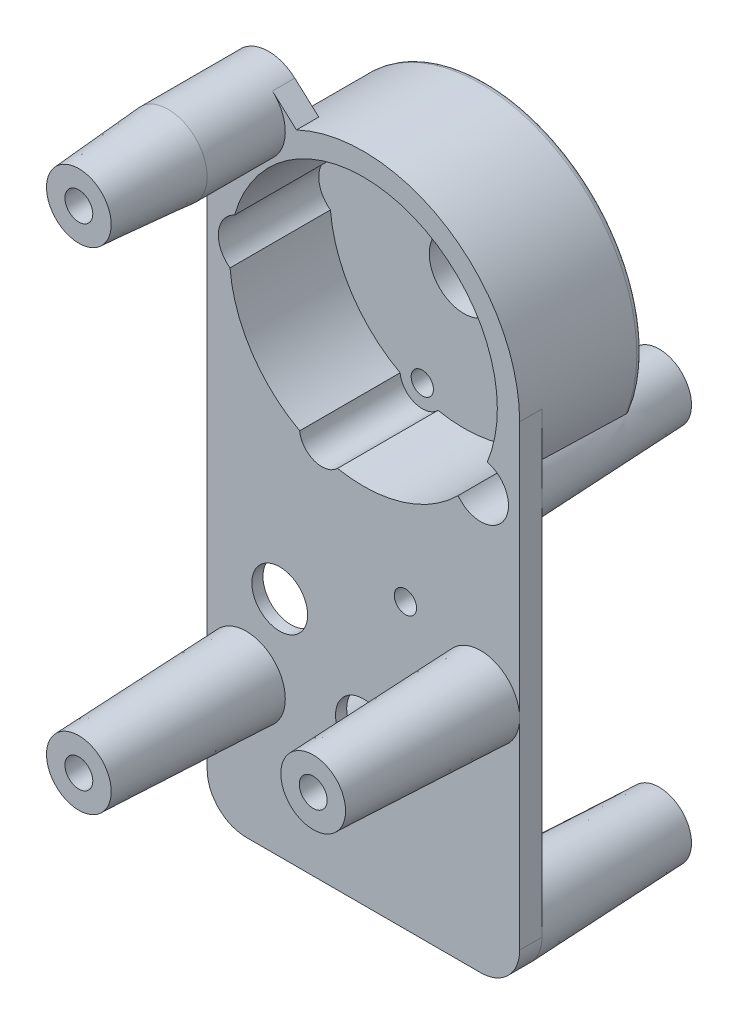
ISO-10303-21;
HEADER;
FILE_DESCRIPTION(('STEP AP214'),'2;1');
FILE_NAME('part.step','',(''),(''),'','','');
FILE_SCHEMA(('AUTOMOTIVE_DESIGN { 1 0 10303 214 1 1 1 1 }'));
ENDSEC;
DATA;
#1=APPLICATION_CONTEXT('core data for automotive mechanical design processes');
#2=APPLICATION_PROTOCOL_DEFINITION('international standard','automotive_design',2000,#1);
#3=PRODUCT_CONTEXT('',#1,'mechanical');
#4=PRODUCT('Part','Part','',(#3));
#5=PRODUCT_RELATED_PRODUCT_CATEGORY('part','',(#4));
#6=PRODUCT_DEFINITION_FORMATION('','',#4);
#7=PRODUCT_DEFINITION_CONTEXT('part definition',#1,'design');
#8=PRODUCT_DEFINITION('design','',#6,#7);
#9=PRODUCT_DEFINITION_SHAPE('','',#8);
#10=(LENGTH_UNIT() NAMED_UNIT(*) SI_UNIT(.MILLI.,.METRE.));
#11=(NAMED_UNIT(*) PLANE_ANGLE_UNIT() SI_UNIT($,.RADIAN.));
#12=(NAMED_UNIT(*) SI_UNIT($,.STERADIAN.) SOLID_ANGLE_UNIT());
#13=UNCERTAINTY_MEASURE_WITH_UNIT(LENGTH_MEASURE(1.E-05),#10,'distance_accuracy_value','');
#14=(GEOMETRIC_REPRESENTATION_CONTEXT(3) GLOBAL_UNCERTAINTY_ASSIGNED_CONTEXT((#13)) GLOBAL_UNIT_ASSIGNED_CONTEXT((#10,
#11,#12)) REPRESENTATION_CONTEXT('',''));
#15=CARTESIAN_POINT('',(0.,0.,0.));
#16=DIRECTION('',(0.,0.,1.));
#17=DIRECTION('',(1.,0.,0.));
#18=AXIS2_PLACEMENT_3D('',#15,#16,#17);
#19=CARTESIAN_POINT('',(0.,0.,-14.));
#20=DIRECTION('',(0.,0.,1.));
#21=DIRECTION('',(1.,0.,0.));
#22=AXIS2_PLACEMENT_3D('',#19,#20,#21);
#23=CYLINDRICAL_SURFACE('',#22,2.5);
#24=CARTESIAN_POINT('',(0.,0.,2.));
#25=DIRECTION('',(0.,0.,1.));
#26=DIRECTION('',(1.,0.,0.));
#27=AXIS2_PLACEMENT_3D('',#24,#25,#26);
#28=CIRCLE('',#27,2.5);
#29=CARTESIAN_POINT('',(2.5,0.,2.));
#30=VERTEX_POINT('',#29);
#31=EDGE_CURVE('E833',#30,#30,#28,.T.);
#32=ORIENTED_EDGE('',*,*,#31,.T.);
#33=EDGE_LOOP('',(#32));
#34=FACE_BOUND('',#33,.T.);
#35=CARTESIAN_POINT('',(0.,0.,0.999999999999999));
#36=DIRECTION('',(0.,0.,-1.));
#37=DIRECTION('',(-1.,0.,0.));
#38=AXIS2_PLACEMENT_3D('',#35,#36,#37);
#39=CIRCLE('',#38,2.5);
#40=CARTESIAN_POINT('',(-2.5,0.,0.999999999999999));
#41=VERTEX_POINT('',#40);
#42=EDGE_CURVE('E823',#41,#41,#39,.F.);
#43=ORIENTED_EDGE('',*,*,#42,.F.);
#44=EDGE_LOOP('',(#43));
#45=FACE_BOUND('',#44,.T.);
#46=ADVANCED_FACE('F34',(#34,#45),#23,.F.);
#47=CARTESIAN_POINT('',(-7.5,6.5,-14.));
#48=DIRECTION('',(0.,0.,1.));
#49=DIRECTION('',(1.,0.,0.));
#50=AXIS2_PLACEMENT_3D('',#47,#48,#49);
#51=CYLINDRICAL_SURFACE('',#50,2.5);
#52=CARTESIAN_POINT('',(-7.5,6.5,2.));
#53=DIRECTION('',(0.,0.,1.));
#54=DIRECTION('',(1.,0.,0.));
#55=AXIS2_PLACEMENT_3D('',#52,#53,#54);
#56=CIRCLE('',#55,2.5);
#57=CARTESIAN_POINT('',(-5.,6.5,2.));
#58=VERTEX_POINT('',#57);
#59=EDGE_CURVE('E835',#58,#58,#56,.T.);
#60=ORIENTED_EDGE('',*,*,#59,.T.);
#61=EDGE_LOOP('',(#60));
#62=FACE_BOUND('',#61,.T.);
#63=CARTESIAN_POINT('',(-7.5,6.5,0.999999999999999));
#64=DIRECTION('',(0.,0.,-1.));
#65=DIRECTION('',(-1.,0.,0.));
#66=AXIS2_PLACEMENT_3D('',#63,#64,#65);
#67=CIRCLE('',#66,2.5);
#68=CARTESIAN_POINT('',(-10.,6.5,0.999999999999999));
#69=VERTEX_POINT('',#68);
#70=EDGE_CURVE('E829',#69,#69,#67,.F.);
#71=ORIENTED_EDGE('',*,*,#70,.F.);
#72=EDGE_LOOP('',(#71));
#73=FACE_BOUND('',#72,.T.);
#74=ADVANCED_FACE('F564',(#62,#73),#51,.F.);
#75=CARTESIAN_POINT('',(0.,31.,-7.));
#76=DIRECTION('',(0.,0.,1.));
#77=DIRECTION('',(1.,0.,0.));
#78=AXIS2_PLACEMENT_3D('',#75,#76,#77);
#79=CYLINDRICAL_SURFACE('',#78,12.);
#80=CARTESIAN_POINT('',(0.,31.,-7.));
#81=DIRECTION('',(0.,0.,1.));
#82=DIRECTION('',(1.,0.,0.));
#83=AXIS2_PLACEMENT_3D('',#80,#81,#82);
#84=CIRCLE('',#83,12.);
#85=CARTESIAN_POINT('',(11.0949705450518,26.4281701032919,-7.));
#86=VERTEX_POINT('',#85);
#87=CARTESIAN_POINT('',(-11.5456357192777,34.2708249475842,-7.));
#88=VERTEX_POINT('',#87);
#89=EDGE_CURVE('E221',#86,#88,#84,.T.);
#90=ORIENTED_EDGE('',*,*,#89,.F.);
#91=DIRECTION('',(0.,0.,1.));
#92=VECTOR('',#91,1.);
#93=CARTESIAN_POINT('',(11.0949705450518,26.4281701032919,-2.5));
#94=LINE('',#93,#92);
#95=CARTESIAN_POINT('',(11.0949705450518,26.4281701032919,2.));
#96=VERTEX_POINT('',#95);
#97=EDGE_CURVE('E205',#86,#96,#94,.T.);
#98=ORIENTED_EDGE('',*,*,#97,.T.);
#99=CARTESIAN_POINT('',(0.,31.,2.));
#100=DIRECTION('',(0.,0.,1.));
#101=DIRECTION('',(1.,0.,0.));
#102=AXIS2_PLACEMENT_3D('',#99,#100,#101);
#103=CIRCLE('',#102,12.);
#104=CARTESIAN_POINT('',(-11.5456357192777,34.2708249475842,2.));
#105=VERTEX_POINT('',#104);
#106=EDGE_CURVE('E236',#96,#105,#103,.T.);
#107=ORIENTED_EDGE('',*,*,#106,.T.);
#108=DIRECTION('',(0.,0.,1.));
#109=VECTOR('',#108,1.);
#110=CARTESIAN_POINT('',(-11.5456357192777,34.2708249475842,-2.5));
#111=LINE('',#110,#109);
#112=EDGE_CURVE('E229',#105,#88,#111,.F.);
#113=ORIENTED_EDGE('',*,*,#112,.T.);
#114=EDGE_LOOP('',(#90,#98,#107,#113));
#115=FACE_BOUND('',#114,.T.);
#116=ADVANCED_FACE('F227',(#115),#79,.F.);
#117=CARTESIAN_POINT('',(-2.31760040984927,19.2259298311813,2.));
#118=VERTEX_POINT('',#117);
#119=CARTESIAN_POINT('',(8.48744703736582,22.516884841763,2.));
#120=VERTEX_POINT('',#119);
#121=EDGE_CURVE('E234',#118,#120,#103,.T.);
#122=ORIENTED_EDGE('',*,*,#121,.T.);
#123=DIRECTION('',(0.,0.,1.));
#124=VECTOR('',#123,1.);
#125=CARTESIAN_POINT('',(8.48744703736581,22.516884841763,-2.5));
#126=LINE('',#125,#124);
#127=CARTESIAN_POINT('',(8.48744703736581,22.516884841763,-7.));
#128=VERTEX_POINT('',#127);
#129=EDGE_CURVE('E216',#120,#128,#126,.F.);
#130=ORIENTED_EDGE('',*,*,#129,.T.);
#131=CARTESIAN_POINT('',(-2.31760040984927,19.2259298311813,-7.));
#132=VERTEX_POINT('',#131);
#133=EDGE_CURVE('E224',#132,#128,#84,.T.);
#134=ORIENTED_EDGE('',*,*,#133,.F.);
#135=DIRECTION('',(0.,0.,1.));
#136=VECTOR('',#135,1.);
#137=CARTESIAN_POINT('',(-2.31760040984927,19.2259298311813,-2.5));
#138=LINE('',#137,#136);
#139=EDGE_CURVE('E858',#132,#118,#138,.T.);
#140=ORIENTED_EDGE('',*,*,#139,.T.);
#141=EDGE_LOOP('',(#122,#130,#134,#140));
#142=FACE_BOUND('',#141,.T.);
#143=ADVANCED_FACE('F546',(#142),#79,.F.);
#144=CARTESIAN_POINT('',(-10.5,43.,0.));
#145=DIRECTION('',(0.,0.,1.));
#146=DIRECTION('',(1.,0.,0.));
#147=AXIS2_PLACEMENT_3D('',#144,#145,#146);
#148=PLANE('',#147);
#149=CARTESIAN_POINT('',(0.,0.,0.));
#150=DIRECTION('',(0.,0.,-1.));
#151=DIRECTION('',(-1.,0.,0.));
#152=AXIS2_PLACEMENT_3D('',#149,#150,#151);
#153=CIRCLE('',#152,4.5);
#154=CARTESIAN_POINT('',(-4.5,0.,0.));
#155=VERTEX_POINT('',#154);
#156=EDGE_CURVE('E815',#155,#155,#153,.T.);
#157=ORIENTED_EDGE('',*,*,#156,.F.);
#158=EDGE_LOOP('',(#157));
#159=FACE_BOUND('',#158,.T.);
#160=CARTESIAN_POINT('',(-7.5,6.5,0.));
#161=DIRECTION('',(0.,0.,-1.));
#162=DIRECTION('',(-1.,0.,0.));
#163=AXIS2_PLACEMENT_3D('',#160,#161,#162);
#164=CIRCLE('',#163,4.5);
#165=CARTESIAN_POINT('',(-12.,6.5,0.));
#166=VERTEX_POINT('',#165);
#167=EDGE_CURVE('E830',#166,#166,#164,.T.);
#168=ORIENTED_EDGE('',*,*,#167,.F.);
#169=EDGE_LOOP('',(#168));
#170=FACE_BOUND('',#169,.T.);
#171=DIRECTION('',(0.,-1.,0.));
#172=VECTOR('',#171,1.);
#173=CARTESIAN_POINT('',(-14.,43.,0.));
#174=LINE('',#173,#172);
#175=CARTESIAN_POINT('',(-14.,31.,0.));
#176=VERTEX_POINT('',#175);
#177=CARTESIAN_POINT('',(-14.,-10.,0.));
#178=VERTEX_POINT('',#177);
#179=EDGE_CURVE('E421',#176,#178,#174,.T.);
#180=ORIENTED_EDGE('',*,*,#179,.F.);
#181=CARTESIAN_POINT('',(0.,31.,0.));
#182=DIRECTION('',(0.,0.,1.));
#183=DIRECTION('',(1.,0.,0.));
#184=AXIS2_PLACEMENT_3D('',#181,#182,#183);
#185=CIRCLE('',#184,14.);
#186=CARTESIAN_POINT('',(9.44240682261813,20.6636102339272,0.));
#187=VERTEX_POINT('',#186);
#188=EDGE_CURVE('E244',#176,#187,#185,.T.);
#189=ORIENTED_EDGE('',*,*,#188,.T.);
#190=CARTESIAN_POINT('',(10.5,24.,0.));
#191=DIRECTION('',(0.,0.,-1.));
#192=DIRECTION('',(-1.,0.,0.));
#193=AXIS2_PLACEMENT_3D('',#190,#191,#192);
#194=CIRCLE('',#193,3.5);
#195=CARTESIAN_POINT('',(14.,24.,0.));
#196=VERTEX_POINT('',#195);
#197=EDGE_CURVE('E480',#196,#187,#194,.T.);
#198=ORIENTED_EDGE('',*,*,#197,.F.);
#199=DIRECTION('',(0.,1.,0.));
#200=VECTOR('',#199,1.);
#201=CARTESIAN_POINT('',(14.,31.,0.));
#202=LINE('',#201,#200);
#203=CARTESIAN_POINT('',(14.,-9.99999999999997,0.));
#204=VERTEX_POINT('',#203);
#205=EDGE_CURVE('E404',#204,#196,#202,.T.);
#206=ORIENTED_EDGE('',*,*,#205,.F.);
#207=CARTESIAN_POINT('',(10.5,-10.,0.));
#208=DIRECTION('',(0.,0.,-1.));
#209=DIRECTION('',(-1.,0.,0.));
#210=AXIS2_PLACEMENT_3D('',#207,#208,#209);
#211=CIRCLE('',#210,3.5);
#212=CARTESIAN_POINT('',(10.5,-13.5,0.));
#213=VERTEX_POINT('',#212);
#214=EDGE_CURVE('E475',#213,#204,#211,.T.);
#215=ORIENTED_EDGE('',*,*,#214,.F.);
#216=DIRECTION('',(1.,0.,0.));
#217=VECTOR('',#216,1.);
#218=CARTESIAN_POINT('',(-10.5,-13.5,0.));
#219=LINE('',#218,#217);
#220=CARTESIAN_POINT('',(-10.5,-13.5,0.));
#221=VERTEX_POINT('',#220);
#222=EDGE_CURVE('E411',#221,#213,#219,.T.);
#223=ORIENTED_EDGE('',*,*,#222,.F.);
#224=CARTESIAN_POINT('',(-10.5,-10.,0.));
#225=DIRECTION('',(0.,0.,-1.));
#226=DIRECTION('',(-1.,0.,0.));
#227=AXIS2_PLACEMENT_3D('',#224,#225,#226);
#228=CIRCLE('',#227,3.5);
#229=EDGE_CURVE('E470',#178,#221,#228,.T.);
#230=ORIENTED_EDGE('',*,*,#229,.F.);
#231=EDGE_LOOP('',(#180,#189,#198,#206,#215,#223,#230));
#232=FACE_BOUND('',#231,.T.);
#233=CARTESIAN_POINT('',(3.76388308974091,11.9198651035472,0.));
#234=DIRECTION('',(0.,0.,1.));
#235=DIRECTION('',(1.,0.,0.));
#236=AXIS2_PLACEMENT_3D('',#233,#234,#235);
#237=CIRCLE('',#236,3.);
#238=CARTESIAN_POINT('',(6.76388308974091,11.9198651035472,0.));
#239=VERTEX_POINT('',#238);
#240=EDGE_CURVE('E252',#239,#239,#237,.F.);
#241=ORIENTED_EDGE('',*,*,#240,.F.);
#242=EDGE_LOOP('',(#241));
#243=FACE_BOUND('',#242,.T.);
#244=ADVANCED_FACE('F531',(#159,#170,#232,#243),#148,.F.);
#245=DIRECTION('',(-0.741639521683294,0.670798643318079,0.));
#246=VECTOR('',#245,1.);
#247=CARTESIAN_POINT('',(-8.15220474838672,45.5957383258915,0.));
#248=LINE('',#247,#246);
#249=CARTESIAN_POINT('',(-6.,43.6491106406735,0.));
#250=VERTEX_POINT('',#249);
#251=CARTESIAN_POINT('',(-8.15220474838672,45.5957383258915,0.));
#252=VERTEX_POINT('',#251);
#253=EDGE_CURVE('E401',#250,#252,#248,.T.);
#254=ORIENTED_EDGE('',*,*,#253,.F.);
#255=CARTESIAN_POINT('',(-13.8585876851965,32.9848293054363,0.));
#256=VERTEX_POINT('',#255);
#257=EDGE_CURVE('E246',#250,#256,#185,.T.);
#258=ORIENTED_EDGE('',*,*,#257,.T.);
#259=CARTESIAN_POINT('',(-10.5,32.,0.));
#260=DIRECTION('',(0.,0.,-1.));
#261=DIRECTION('',(-1.,0.,0.));
#262=AXIS2_PLACEMENT_3D('',#259,#260,#261);
#263=CIRCLE('',#262,3.5);
#264=CARTESIAN_POINT('',(-14.,32.,0.));
#265=VERTEX_POINT('',#264);
#266=EDGE_CURVE('E463',#265,#256,#263,.T.);
#267=ORIENTED_EDGE('',*,*,#266,.F.);
#268=CARTESIAN_POINT('',(-14.,43.,0.));
#269=VERTEX_POINT('',#268);
#270=EDGE_CURVE('E417',#269,#265,#174,.T.);
#271=ORIENTED_EDGE('',*,*,#270,.F.);
#272=CARTESIAN_POINT('',(-10.5,43.,0.));
#273=DIRECTION('',(0.,0.,1.));
#274=DIRECTION('',(1.,0.,0.));
#275=AXIS2_PLACEMENT_3D('',#272,#273,#274);
#276=CIRCLE('',#275,3.5);
#277=EDGE_CURVE('E422',#252,#269,#276,.T.);
#278=ORIENTED_EDGE('',*,*,#277,.F.);
#279=EDGE_LOOP('',(#254,#258,#267,#271,#278));
#280=FACE_BOUND('',#279,.T.);
#281=ADVANCED_FACE('F545',(#280),#148,.F.);
#282=CARTESIAN_POINT('',(-13.9841089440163,31.6668560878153,0.));
#283=VERTEX_POINT('',#282);
#284=EDGE_CURVE('E466',#283,#265,#263,.T.);
#285=ORIENTED_EDGE('',*,*,#284,.F.);
#286=EDGE_CURVE('E261',#283,#176,#185,.T.);
#287=ORIENTED_EDGE('',*,*,#286,.T.);
#288=EDGE_CURVE('E420',#265,#176,#174,.T.);
#289=ORIENTED_EDGE('',*,*,#288,.F.);
#290=EDGE_LOOP('',(#285,#287,#289));
#291=FACE_BOUND('',#290,.T.);
#292=ADVANCED_FACE('F553',(#291),#148,.F.);
#293=CARTESIAN_POINT('',(10.5,24.,-14.));
#294=DIRECTION('',(0.,0.,-1.));
#295=DIRECTION('',(-1.,0.,0.));
#296=AXIS2_PLACEMENT_3D('',#293,#294,#295);
#297=CYLINDRICAL_SURFACE('',#296,1.24999999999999);
#298=CARTESIAN_POINT('',(10.5,24.,-14.));
#299=DIRECTION('',(0.,0.,-1.));
#300=DIRECTION('',(-1.,0.,0.));
#301=AXIS2_PLACEMENT_3D('',#298,#299,#300);
#302=CIRCLE('',#301,1.24999999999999);
#303=CARTESIAN_POINT('',(9.25000000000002,24.,-14.));
#304=VERTEX_POINT('',#303);
#305=EDGE_CURVE('E512',#304,#304,#302,.T.);
#306=ORIENTED_EDGE('',*,*,#305,.T.);
#307=EDGE_LOOP('',(#306));
#308=FACE_BOUND('',#307,.T.);
#309=CARTESIAN_POINT('',(10.5,24.,-9.));
#310=DIRECTION('',(0.,0.,1.));
#311=DIRECTION('',(1.,0.,0.));
#312=AXIS2_PLACEMENT_3D('',#309,#310,#311);
#313=CIRCLE('',#312,1.24999999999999);
#314=CARTESIAN_POINT('',(11.75,24.,-9.));
#315=VERTEX_POINT('',#314);
#316=EDGE_CURVE('E249',#315,#315,#313,.F.);
#317=ORIENTED_EDGE('',*,*,#316,.F.);
#318=EDGE_LOOP('',(#317));
#319=FACE_BOUND('',#318,.T.);
#320=ADVANCED_FACE('F561',(#308,#319),#297,.F.);
#321=CARTESIAN_POINT('',(13.1729777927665,26.2594666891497,0.));
#322=VERTEX_POINT('',#321);
#323=EDGE_CURVE('E482',#322,#196,#194,.T.);
#324=ORIENTED_EDGE('',*,*,#323,.F.);
#325=CARTESIAN_POINT('',(14.,31.,0.));
#326=VERTEX_POINT('',#325);
#327=EDGE_CURVE('E241',#322,#326,#185,.T.);
#328=ORIENTED_EDGE('',*,*,#327,.T.);
#329=EDGE_CURVE('E407',#196,#326,#202,.T.);
#330=ORIENTED_EDGE('',*,*,#329,.F.);
#331=EDGE_LOOP('',(#324,#328,#330));
#332=FACE_BOUND('',#331,.T.);
#333=ADVANCED_FACE('F548',(#332),#148,.F.);
#334=CARTESIAN_POINT('',(-10.5,43.,2.));
#335=DIRECTION('',(0.,0.,1.));
#336=DIRECTION('',(1.,0.,0.));
#337=AXIS2_PLACEMENT_3D('',#334,#335,#336);
#338=PLANE('',#337);
#339=ORIENTED_EDGE('',*,*,#31,.F.);
#340=EDGE_LOOP('',(#339));
#341=FACE_BOUND('',#340,.T.);
#342=ORIENTED_EDGE('',*,*,#59,.F.);
#343=EDGE_LOOP('',(#342));
#344=FACE_BOUND('',#343,.T.);
#345=CARTESIAN_POINT('',(3.76388308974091,11.9198651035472,2.));
#346=DIRECTION('',(0.,0.,1.));
#347=DIRECTION('',(1.,0.,0.));
#348=AXIS2_PLACEMENT_3D('',#345,#346,#347);
#349=CIRCLE('',#348,1.);
#350=CARTESIAN_POINT('',(4.76388308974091,11.9198651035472,2.));
#351=VERTEX_POINT('',#350);
#352=EDGE_CURVE('E842',#351,#351,#349,.T.);
#353=ORIENTED_EDGE('',*,*,#352,.F.);
#354=EDGE_LOOP('',(#353));
#355=FACE_BOUND('',#354,.T.);
#356=CARTESIAN_POINT('',(10.5,24.,2.));
#357=DIRECTION('',(0.,0.,1.));
#358=DIRECTION('',(1.,0.,0.));
#359=AXIS2_PLACEMENT_3D('',#356,#357,#358);
#360=CIRCLE('',#359,2.5);
#361=EDGE_CURVE('E211',#120,#96,#360,.T.);
#362=ORIENTED_EDGE('',*,*,#361,.F.);
#363=ORIENTED_EDGE('',*,*,#121,.F.);
#364=CARTESIAN_POINT('',(-3.72278691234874,20.6491131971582,2.));
#365=DIRECTION('',(0.,0.,1.));
#366=DIRECTION('',(1.,0.,0.));
#367=AXIS2_PLACEMENT_3D('',#364,#365,#366);
#368=CIRCLE('',#367,2.);
#369=CARTESIAN_POINT('',(-5.71254326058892,20.4469507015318,2.));
#370=VERTEX_POINT('',#369);
#371=EDGE_CURVE('E215',#370,#118,#368,.T.);
#372=ORIENTED_EDGE('',*,*,#371,.F.);
#373=CARTESIAN_POINT('',(-11.9554878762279,29.9673772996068,2.));
#374=VERTEX_POINT('',#373);
#375=EDGE_CURVE('E230',#374,#370,#103,.T.);
#376=ORIENTED_EDGE('',*,*,#375,.F.);
#377=CARTESIAN_POINT('',(-10.5,32.,2.));
#378=DIRECTION('',(0.,0.,1.));
#379=DIRECTION('',(1.,0.,0.));
#380=AXIS2_PLACEMENT_3D('',#377,#378,#379);
#381=CIRCLE('',#380,2.5);
#382=EDGE_CURVE('E861',#105,#374,#381,.T.);
#383=ORIENTED_EDGE('',*,*,#382,.F.);
#384=ORIENTED_EDGE('',*,*,#106,.F.);
#385=EDGE_LOOP('',(#362,#363,#372,#376,#383,#384));
#386=FACE_BOUND('',#385,.T.);
#387=DIRECTION('',(0.,1.,0.));
#388=VECTOR('',#387,1.);
#389=CARTESIAN_POINT('',(14.,31.,2.));
#390=LINE('',#389,#388);
#391=CARTESIAN_POINT('',(14.,8.,2.));
#392=VERTEX_POINT('',#391);
#393=CARTESIAN_POINT('',(14.,31.,2.));
#394=VERTEX_POINT('',#393);
#395=EDGE_CURVE('E432',#392,#394,#390,.T.);
#396=ORIENTED_EDGE('',*,*,#395,.T.);
#397=CARTESIAN_POINT('',(0.,31.,2.));
#398=DIRECTION('',(0.,0.,1.));
#399=DIRECTION('',(1.,0.,0.));
#400=AXIS2_PLACEMENT_3D('',#397,#398,#399);
#401=CIRCLE('',#400,14.);
#402=CARTESIAN_POINT('',(-6.,43.6491106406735,2.));
#403=VERTEX_POINT('',#402);
#404=EDGE_CURVE('E428',#394,#403,#401,.T.);
#405=ORIENTED_EDGE('',*,*,#404,.T.);
#406=DIRECTION('',(-0.741639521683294,0.670798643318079,0.));
#407=VECTOR('',#406,1.);
#408=CARTESIAN_POINT('',(-8.15220474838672,45.5957383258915,2.));
#409=LINE('',#408,#407);
#410=CARTESIAN_POINT('',(-8.15220474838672,45.5957383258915,2.));
#411=VERTEX_POINT('',#410);
#412=EDGE_CURVE('E400',#403,#411,#409,.T.);
#413=ORIENTED_EDGE('',*,*,#412,.T.);
#414=CARTESIAN_POINT('',(-10.5,43.,2.));
#415=DIRECTION('',(0.,0.,1.));
#416=DIRECTION('',(1.,0.,0.));
#417=AXIS2_PLACEMENT_3D('',#414,#415,#416);
#418=CIRCLE('',#417,3.5);
#419=CARTESIAN_POINT('',(-14.,43.,2.));
#420=VERTEX_POINT('',#419);
#421=EDGE_CURVE('E453',#420,#411,#418,.T.);
#422=ORIENTED_EDGE('',*,*,#421,.F.);
#423=DIRECTION('',(0.,-1.,0.));
#424=VECTOR('',#423,1.);
#425=CARTESIAN_POINT('',(-14.,43.,2.));
#426=LINE('',#425,#424);
#427=CARTESIAN_POINT('',(-14.,-1.,2.));
#428=VERTEX_POINT('',#427);
#429=EDGE_CURVE('E439',#420,#428,#426,.T.);
#430=ORIENTED_EDGE('',*,*,#429,.T.);
#431=CARTESIAN_POINT('',(-10.5,-1.,2.));
#432=DIRECTION('',(0.,0.,1.));
#433=DIRECTION('',(1.,0.,0.));
#434=AXIS2_PLACEMENT_3D('',#431,#432,#433);
#435=CIRCLE('',#434,3.5);
#436=EDGE_CURVE('E449',#428,#428,#435,.T.);
#437=ORIENTED_EDGE('',*,*,#436,.F.);
#438=CARTESIAN_POINT('',(-14.,-9.99999999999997,2.));
#439=VERTEX_POINT('',#438);
#440=EDGE_CURVE('E403',#428,#439,#426,.T.);
#441=ORIENTED_EDGE('',*,*,#440,.T.);
#442=CARTESIAN_POINT('',(-10.5,-10.,2.));
#443=DIRECTION('',(0.,0.,1.));
#444=DIRECTION('',(1.,0.,0.));
#445=AXIS2_PLACEMENT_3D('',#442,#443,#444);
#446=CIRCLE('',#445,3.5);
#447=CARTESIAN_POINT('',(-10.5,-13.5,2.));
#448=VERTEX_POINT('',#447);
#449=EDGE_CURVE('E437',#439,#448,#446,.T.);
#450=ORIENTED_EDGE('',*,*,#449,.T.);
#451=DIRECTION('',(1.,0.,0.));
#452=VECTOR('',#451,1.);
#453=CARTESIAN_POINT('',(-10.5,-13.5,2.));
#454=LINE('',#453,#452);
#455=CARTESIAN_POINT('',(10.5,-13.5,2.));
#456=VERTEX_POINT('',#455);
#457=EDGE_CURVE('E435',#448,#456,#454,.T.);
#458=ORIENTED_EDGE('',*,*,#457,.T.);
#459=CARTESIAN_POINT('',(10.5,-10.,2.));
#460=DIRECTION('',(0.,0.,1.));
#461=DIRECTION('',(-1.,0.,0.));
#462=AXIS2_PLACEMENT_3D('',#459,#460,#461);
#463=CIRCLE('',#462,3.5);
#464=CARTESIAN_POINT('',(14.,-9.99999999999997,2.));
#465=VERTEX_POINT('',#464);
#466=EDGE_CURVE('E433',#456,#465,#463,.T.);
#467=ORIENTED_EDGE('',*,*,#466,.T.);
#468=EDGE_CURVE('E430',#465,#392,#390,.T.);
#469=ORIENTED_EDGE('',*,*,#468,.T.);
#470=CARTESIAN_POINT('',(10.5,8.,2.));
#471=DIRECTION('',(0.,0.,1.));
#472=DIRECTION('',(1.,0.,0.));
#473=AXIS2_PLACEMENT_3D('',#470,#471,#472);
#474=CIRCLE('',#473,3.5);
#475=EDGE_CURVE('E443',#392,#392,#474,.T.);
#476=ORIENTED_EDGE('',*,*,#475,.F.);
#477=EDGE_LOOP('',(#396,#405,#413,#422,#430,#437,#441,#450,#458,#467,#469,#476));
#478=FACE_BOUND('',#477,.T.);
#479=ADVANCED_FACE('F560',(#341,#344,#355,#386,#478),#338,.T.);
#480=CARTESIAN_POINT('',(-10.5,43.,2.));
#481=DIRECTION('',(0.,0.,-1.));
#482=DIRECTION('',(-1.,0.,0.));
#483=AXIS2_PLACEMENT_3D('',#480,#481,#482);
#484=CYLINDRICAL_SURFACE('',#483,3.5);
#485=ORIENTED_EDGE('',*,*,#277,.T.);
#486=DIRECTION('',(0.,0.,-1.));
#487=VECTOR('',#486,1.);
#488=CARTESIAN_POINT('',(-14.,43.,2.));
#489=LINE('',#488,#487);
#490=EDGE_CURVE('E375',#420,#269,#489,.T.);
#491=ORIENTED_EDGE('',*,*,#490,.F.);
#492=ORIENTED_EDGE('',*,*,#421,.T.);
#493=DIRECTION('',(0.,0.,-1.));
#494=VECTOR('',#493,1.);
#495=CARTESIAN_POINT('',(-8.15220474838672,45.5957383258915,2.));
#496=LINE('',#495,#494);
#497=EDGE_CURVE('E397',#411,#252,#496,.T.);
#498=ORIENTED_EDGE('',*,*,#497,.T.);
#499=EDGE_LOOP('',(#485,#491,#492,#498));
#500=FACE_BOUND('',#499,.T.);
#501=CARTESIAN_POINT('',(-10.5,43.,9.));
#502=DIRECTION('',(0.,0.,1.));
#503=DIRECTION('',(1.,0.,0.));
#504=AXIS2_PLACEMENT_3D('',#501,#502,#503);
#505=CIRCLE('',#504,3.5);
#506=CARTESIAN_POINT('',(-7.,43.,9.));
#507=VERTEX_POINT('',#506);
#508=EDGE_CURVE('E452',#507,#507,#505,.T.);
#509=ORIENTED_EDGE('',*,*,#508,.F.);
#510=EDGE_LOOP('',(#509));
#511=FACE_BOUND('',#510,.T.);
#512=ADVANCED_FACE('F663',(#500,#511),#484,.T.);
#513=CARTESIAN_POINT('',(-14.,43.,2.));
#514=DIRECTION('',(1.,0.,0.));
#515=DIRECTION('',(0.,1.,0.));
#516=AXIS2_PLACEMENT_3D('',#513,#514,#515);
#517=PLANE('',#516);
#518=ORIENTED_EDGE('',*,*,#288,.T.);
#519=ORIENTED_EDGE('',*,*,#179,.T.);
#520=DIRECTION('',(0.,0.,-1.));
#521=VECTOR('',#520,1.);
#522=CARTESIAN_POINT('',(-14.,-9.99999999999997,2.));
#523=LINE('',#522,#521);
#524=EDGE_CURVE('E379',#439,#178,#523,.T.);
#525=ORIENTED_EDGE('',*,*,#524,.F.);
#526=ORIENTED_EDGE('',*,*,#440,.F.);
#527=ORIENTED_EDGE('',*,*,#429,.F.);
#528=ORIENTED_EDGE('',*,*,#490,.T.);
#529=ORIENTED_EDGE('',*,*,#270,.T.);
#530=EDGE_LOOP('',(#518,#519,#525,#526,#527,#528,#529));
#531=FACE_BOUND('',#530,.T.);
#532=ADVANCED_FACE('F902',(#531),#517,.F.);
#533=CARTESIAN_POINT('',(-10.5,-10.,2.));
#534=DIRECTION('',(0.,0.,-1.));
#535=DIRECTION('',(-1.,0.,0.));
#536=AXIS2_PLACEMENT_3D('',#533,#534,#535);
#537=CYLINDRICAL_SURFACE('',#536,3.5);
#538=CARTESIAN_POINT('',(-10.5,-10.,0.));
#539=DIRECTION('',(0.,0.,1.));
#540=DIRECTION('',(1.,0.,0.));
#541=AXIS2_PLACEMENT_3D('',#538,#539,#540);
#542=CIRCLE('',#541,3.5);
#543=EDGE_CURVE('E414',#178,#221,#542,.T.);
#544=ORIENTED_EDGE('',*,*,#543,.T.);
#545=DIRECTION('',(0.,0.,-1.));
#546=VECTOR('',#545,1.);
#547=CARTESIAN_POINT('',(-10.5,-13.5,2.));
#548=LINE('',#547,#546);
#549=EDGE_CURVE('E384',#448,#221,#548,.T.);
#550=ORIENTED_EDGE('',*,*,#549,.F.);
#551=ORIENTED_EDGE('',*,*,#449,.F.);
#552=ORIENTED_EDGE('',*,*,#524,.T.);
#553=EDGE_LOOP('',(#544,#550,#551,#552));
#554=FACE_BOUND('',#553,.T.);
#555=ADVANCED_FACE('F1096',(#554),#537,.T.);
#556=CARTESIAN_POINT('',(-10.5,-13.5,2.));
#557=DIRECTION('',(0.,1.,0.));
#558=DIRECTION('',(0.,0.,1.));
#559=AXIS2_PLACEMENT_3D('',#556,#557,#558);
#560=PLANE('',#559);
#561=ORIENTED_EDGE('',*,*,#222,.T.);
#562=DIRECTION('',(0.,0.,-1.));
#563=VECTOR('',#562,1.);
#564=CARTESIAN_POINT('',(10.5,-13.5,2.));
#565=LINE('',#564,#563);
#566=EDGE_CURVE('E387',#456,#213,#565,.T.);
#567=ORIENTED_EDGE('',*,*,#566,.F.);
#568=ORIENTED_EDGE('',*,*,#457,.F.);
#569=ORIENTED_EDGE('',*,*,#549,.T.);
#570=EDGE_LOOP('',(#561,#567,#568,#569));
#571=FACE_BOUND('',#570,.T.);
#572=ADVANCED_FACE('F1106',(#571),#560,.F.);
#573=CARTESIAN_POINT('',(10.5,-10.,2.));
#574=DIRECTION('',(0.,0.,-1.));
#575=DIRECTION('',(-1.,0.,0.));
#576=AXIS2_PLACEMENT_3D('',#573,#574,#575);
#577=CYLINDRICAL_SURFACE('',#576,3.5);
#578=CARTESIAN_POINT('',(10.5,-10.,0.));
#579=DIRECTION('',(0.,0.,1.));
#580=DIRECTION('',(-1.,0.,0.));
#581=AXIS2_PLACEMENT_3D('',#578,#579,#580);
#582=CIRCLE('',#581,3.5);
#583=EDGE_CURVE('E408',#213,#204,#582,.T.);
#584=ORIENTED_EDGE('',*,*,#583,.T.);
#585=DIRECTION('',(0.,0.,-1.));
#586=VECTOR('',#585,1.);
#587=CARTESIAN_POINT('',(14.,-9.99999999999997,2.));
#588=LINE('',#587,#586);
#589=EDGE_CURVE('E390',#465,#204,#588,.T.);
#590=ORIENTED_EDGE('',*,*,#589,.F.);
#591=ORIENTED_EDGE('',*,*,#466,.F.);
#592=ORIENTED_EDGE('',*,*,#566,.T.);
#593=EDGE_LOOP('',(#584,#590,#591,#592));
#594=FACE_BOUND('',#593,.T.);
#595=ADVANCED_FACE('F1114',(#594),#577,.T.);
#596=CARTESIAN_POINT('',(14.,31.,2.));
#597=DIRECTION('',(-1.,0.,0.));
#598=DIRECTION('',(0.,-1.,0.));
#599=AXIS2_PLACEMENT_3D('',#596,#597,#598);
#600=PLANE('',#599);
#601=ORIENTED_EDGE('',*,*,#205,.T.);
#602=ORIENTED_EDGE('',*,*,#329,.T.);
#603=DIRECTION('',(0.,0.,-1.));
#604=VECTOR('',#603,1.);
#605=CARTESIAN_POINT('',(14.,31.,2.));
#606=LINE('',#605,#604);
#607=EDGE_CURVE('E393',#394,#326,#606,.T.);
#608=ORIENTED_EDGE('',*,*,#607,.F.);
#609=ORIENTED_EDGE('',*,*,#395,.F.);
#610=ORIENTED_EDGE('',*,*,#468,.F.);
#611=ORIENTED_EDGE('',*,*,#589,.T.);
#612=EDGE_LOOP('',(#601,#602,#608,#609,#610,#611));
#613=FACE_BOUND('',#612,.T.);
#614=ADVANCED_FACE('F340',(#613),#600,.F.);
#615=CARTESIAN_POINT('',(0.,31.,2.));
#616=DIRECTION('',(0.,0.,-1.));
#617=DIRECTION('',(-1.,0.,0.));
#618=AXIS2_PLACEMENT_3D('',#615,#616,#617);
#619=CYLINDRICAL_SURFACE('',#618,14.);
#620=CARTESIAN_POINT('',(13.0140360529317,25.8391022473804,-9.0002));
#621=CARTESIAN_POINT('',(13.03256715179,25.8858331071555,-8.00573081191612));
#622=CARTESIAN_POINT('',(13.0507623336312,25.9324482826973,-7.01124996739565));
#623=CARTESIAN_POINT('',(13.0865104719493,26.0254916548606,-5.02226829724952));
#624=CARTESIAN_POINT('',(13.1040634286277,26.0719198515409,-4.02776747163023));
#625=CARTESIAN_POINT('',(13.1388452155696,26.1654090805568,-2.02211373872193));
#626=CARTESIAN_POINT('',(13.1560637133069,26.2124677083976,-1.01096054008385));
#627=CARTESIAN_POINT('',(13.172981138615,26.2594759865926,0.00019999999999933));
#628=B_SPLINE_CURVE_WITH_KNOTS('',3,(#620,#621,#622,#623,#624,#625,#626,#627),.UNSPECIFIED.,.F.,
.F.,(4,2,2,4),(0.,2.98721685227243,5.9744327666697,9.01161478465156),.UNSPECIFIED.);
#629=CARTESIAN_POINT('',(13.0233291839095,25.8625982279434,-8.5));
#630=VERTEX_POINT('',#629);
#631=EDGE_CURVE('E279',#630,#322,#628,.T.);
#632=ORIENTED_EDGE('',*,*,#631,.F.);
#633=CARTESIAN_POINT('',(0.,31.,-8.5));
#634=DIRECTION('',(0.,0.,1.));
#635=DIRECTION('',(1.,0.,0.));
#636=AXIS2_PLACEMENT_3D('',#633,#634,#635);
#637=CIRCLE('',#636,14.);
#638=CARTESIAN_POINT('',(-13.7783745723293,33.481208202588,-8.5));
#639=VERTEX_POINT('',#638);
#640=EDGE_CURVE('E352',#630,#639,#637,.T.);
#641=ORIENTED_EDGE('',*,*,#640,.T.);
#642=CARTESIAN_POINT('',(-12.8767992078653,34.0133437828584,-9.));
#643=CARTESIAN_POINT('',(-13.1318887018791,34.0197457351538,-9.15580162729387));
#644=CARTESIAN_POINT('',(-13.3765816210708,34.1277898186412,-9.02224402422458));
#645=CARTESIAN_POINT('',(-13.6212745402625,34.2358339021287,-8.8886864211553));
#646=CARTESIAN_POINT('',(-13.5977867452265,34.3316956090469,-8.6064726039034));
#647=CARTESIAN_POINT('',(-12.890978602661,33.9966064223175,-9.));
#648=CARTESIAN_POINT('',(-13.1450948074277,34.0087583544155,-9.14922856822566));
#649=CARTESIAN_POINT('',(-13.3855149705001,34.1124505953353,-9.0134179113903));
#650=CARTESIAN_POINT('',(-13.6258696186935,34.2162605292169,-8.87767143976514));
#651=CARTESIAN_POINT('',(-13.6044360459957,34.3045598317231,-8.59706252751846));
#652=CARTESIAN_POINT('',(-12.9052650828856,33.9793805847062,-9.));
#653=CARTESIAN_POINT('',(-13.1583622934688,33.9962957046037,-9.14253780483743));
#654=CARTESIAN_POINT('',(-13.3945644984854,34.0958509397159,-9.00482317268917));
#655=CARTESIAN_POINT('',(-13.6307056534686,34.195525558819,-8.8671642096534));
#656=CARTESIAN_POINT('',(-13.6110757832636,34.2771070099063,-8.58855603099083));
#657=CARTESIAN_POINT('',(-12.9339279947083,33.9440262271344,-9.));
#658=CARTESIAN_POINT('',(-13.184783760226,33.9689460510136,-9.12921879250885));
#659=CARTESIAN_POINT('',(-13.4127657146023,34.0605799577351,-8.9882249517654));
#660=CARTESIAN_POINT('',(-13.6406877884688,34.1523288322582,-8.84728572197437));
#661=CARTESIAN_POINT('',(-13.624287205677,34.2217392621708,-8.57312111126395));
#662=CARTESIAN_POINT('',(-12.9483043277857,33.9258985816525,-9.));
#663=CARTESIAN_POINT('',(-13.1979446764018,33.9540710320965,-9.12258700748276));
#664=CARTESIAN_POINT('',(-13.4219172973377,34.0419106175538,-8.98022091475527));
#665=CARTESIAN_POINT('',(-13.6458338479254,34.1298701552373,-8.83790132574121));
#666=CARTESIAN_POINT('',(-13.6308589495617,34.193824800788,-8.56619119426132));
#667=CARTESIAN_POINT('',(-12.9912631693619,33.8704313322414,-9.));
#668=CARTESIAN_POINT('',(-13.2368446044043,33.9067701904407,-9.10325276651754));
#669=CARTESIAN_POINT('',(-13.4492544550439,33.983639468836,-8.95734768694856));
#670=CARTESIAN_POINT('',(-13.661444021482,34.0609774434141,-8.81162773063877));
#671=CARTESIAN_POINT('',(-13.6503454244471,34.109880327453,-8.5474690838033));
#672=CARTESIAN_POINT('',(-13.0198355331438,33.8318200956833,-9.));
#673=CARTESIAN_POINT('',(-13.2624272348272,33.8712793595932,-9.09088910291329));
#674=CARTESIAN_POINT('',(-13.4674244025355,33.9415943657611,-8.943516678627));
#675=CARTESIAN_POINT('',(-13.67223574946,34.0123688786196,-8.79627332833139));
#676=CARTESIAN_POINT('',(-13.663106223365,34.0533444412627,-8.53764531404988));
#677=CARTESIAN_POINT('',(-13.0761927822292,33.7516706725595,-9.));
#678=CARTESIAN_POINT('',(-13.3121256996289,33.7947806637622,-9.06798376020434));
#679=CARTESIAN_POINT('',(-13.503100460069,33.853244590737,-8.91873982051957));
#680=CARTESIAN_POINT('',(-13.6938919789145,33.9121629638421,-8.76962311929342));
#681=CARTESIAN_POINT('',(-13.6879771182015,33.9398383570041,-8.52197768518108));
#682=CARTESIAN_POINT('',(-13.103980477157,33.7101454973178,-9.));
#683=CARTESIAN_POINT('',(-13.3362964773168,33.7537998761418,-9.05740030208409));
#684=CARTESIAN_POINT('',(-13.5206090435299,33.80695860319,-8.90778206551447));
#685=CARTESIAN_POINT('',(-13.7047701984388,33.86054022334,-8.75825086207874));
#686=CARTESIAN_POINT('',(-13.7000897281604,33.8828709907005,-8.51611723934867));
#687=CARTESIAN_POINT('',(-13.1584856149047,33.624125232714,-9.));
#688=CARTESIAN_POINT('',(-13.3830910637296,33.6674612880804,-9.0380394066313));
#689=CARTESIAN_POINT('',(-13.5547920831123,33.7110678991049,-8.88836815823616));
#690=CARTESIAN_POINT('',(-13.7263433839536,33.7550963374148,-8.73878090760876));
#691=CARTESIAN_POINT('',(-13.7236663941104,33.7684651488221,-8.5073353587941));
#692=CARTESIAN_POINT('',(-13.1852010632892,33.5796249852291,-9.));
#693=CARTESIAN_POINT('',(-13.4057563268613,33.6220774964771,-9.02923667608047));
#694=CARTESIAN_POINT('',(-13.5714649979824,33.6614574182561,-8.87991649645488));
#695=CARTESIAN_POINT('',(-13.7370537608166,33.7012214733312,-8.73064759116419));
#696=CARTESIAN_POINT('',(-13.7351292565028,33.7110260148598,-8.50441917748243));
#697=CARTESIAN_POINT('',(-13.2668035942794,33.4353646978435,-9.));
#698=CARTESIAN_POINT('',(-13.4739555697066,33.4746921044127,-9.00439874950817));
#699=CARTESIAN_POINT('',(-13.6222273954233,33.5016383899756,-8.85674107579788));
#700=CARTESIAN_POINT('',(-13.7699436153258,33.5303199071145,-8.70934441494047));
#701=CARTESIAN_POINT('',(-13.7700528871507,33.530104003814,-8.49863368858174));
#702=CARTESIAN_POINT('',(-13.3189439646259,33.3306429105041,-9.));
#703=CARTESIAN_POINT('',(-13.5168733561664,33.3657650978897,-8.99123263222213));
#704=CARTESIAN_POINT('',(-13.6544136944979,33.3870512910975,-8.84590762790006));
#705=CARTESIAN_POINT('',(-13.7916312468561,33.4096323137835,-8.70067467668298));
#706=CARTESIAN_POINT('',(-13.7922323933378,33.4062627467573,-8.4996368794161));
#707=CARTESIAN_POINT('',(-13.412801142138,33.1102603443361,-9.));
#708=CARTESIAN_POINT('',(-13.5933240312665,33.1380608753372,-8.97104818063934));
#709=CARTESIAN_POINT('',(-13.7128750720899,33.150983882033,-8.83053604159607));
#710=CARTESIAN_POINT('',(-13.8321093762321,33.1651943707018,-8.69010007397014));
#711=CARTESIAN_POINT('',(-13.8332389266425,33.1580920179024,-8.50547372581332));
#712=CARTESIAN_POINT('',(-13.4545076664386,32.9945889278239,-9.));
#713=CARTESIAN_POINT('',(-13.6271205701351,33.0188715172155,-8.96392401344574));
#714=CARTESIAN_POINT('',(-13.7391443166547,33.0294969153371,-8.82600409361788));
#715=CARTESIAN_POINT('',(-13.8510190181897,33.0409274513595,-8.68810478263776));
#716=CARTESIAN_POINT('',(-13.8520626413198,33.0337621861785,-8.51031114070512));
#717=CARTESIAN_POINT('',(-13.5246270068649,32.7549421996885,-9.));
#718=CARTESIAN_POINT('',(-13.684484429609,32.7742037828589,-8.9538290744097));
#719=CARTESIAN_POINT('',(-13.7851126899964,32.7820001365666,-8.82015270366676));
#720=CARTESIAN_POINT('',(-13.8855919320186,32.7905961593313,-8.68649367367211));
#721=CARTESIAN_POINT('',(-13.8863824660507,32.7844393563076,-8.51917584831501));
#722=CARTESIAN_POINT('',(-13.5530237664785,32.6309570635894,-9.));
#723=CARTESIAN_POINT('',(-13.7082262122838,32.648243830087,-8.95081522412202));
#724=CARTESIAN_POINT('',(-13.8048038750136,32.6559850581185,-8.81883713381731));
#725=CARTESIAN_POINT('',(-13.9013450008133,32.6640146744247,-8.68686195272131));
#726=CARTESIAN_POINT('',(-13.9018745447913,32.6594457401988,-8.52320215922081));
#727=CARTESIAN_POINT('',(-13.5944216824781,32.3789068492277,-9.));
#728=CARTESIAN_POINT('',(-13.7447159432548,32.393805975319,-8.947684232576));
#729=CARTESIAN_POINT('',(-13.837053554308,32.4019730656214,-8.81747861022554));
#730=CARTESIAN_POINT('',(-13.9293541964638,32.4104307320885,-8.68727317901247));
#731=CARTESIAN_POINT('',(-13.9294782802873,32.4090718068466,-8.52744943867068));
#732=CARTESIAN_POINT('',(-13.6074316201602,32.2508441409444,-9.));
#733=CARTESIAN_POINT('',(-13.7575705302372,32.264809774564,-8.94755238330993));
#734=CARTESIAN_POINT('',(-13.8496161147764,32.2739773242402,-8.81743493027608));
#735=CARTESIAN_POINT('',(-13.9416781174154,32.2829057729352,-8.68731790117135));
#736=CARTESIAN_POINT('',(-13.9415918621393,32.283691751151,-8.52767257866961));
#737=CARTESIAN_POINT('',(-13.6176056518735,31.9937466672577,-9.));
#738=CARTESIAN_POINT('',(-13.7721148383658,32.0063062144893,-8.95010392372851));
#739=CARTESIAN_POINT('',(-13.8674904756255,32.0167549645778,-8.81852033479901));
#740=CARTESIAN_POINT('',(-13.9628831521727,32.0269613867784,-8.68693836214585));
#741=CARTESIAN_POINT('',(-13.9625611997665,32.0310965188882,-8.52413822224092));
#742=CARTESIAN_POINT('',(-13.6145615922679,31.8647209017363,-9.));
#743=CARTESIAN_POINT('',(-13.7736662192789,31.8762689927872,-8.9528347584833));
#744=CARTESIAN_POINT('',(-13.8727059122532,31.8875339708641,-8.81966466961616));
#745=CARTESIAN_POINT('',(-13.9717553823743,31.8980115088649,-8.68650628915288));
#746=CARTESIAN_POINT('',(-13.9713725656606,31.9038786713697,-8.52032894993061));
#747=CARTESIAN_POINT('',(-13.5932611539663,31.6119747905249,-9.));
#748=CARTESIAN_POINT('',(-13.7653809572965,31.6210981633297,-8.96233289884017));
#749=CARTESIAN_POINT('',(-13.8756161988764,31.6319905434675,-8.82501705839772));
#750=CARTESIAN_POINT('',(-13.985859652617,31.6420903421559,-8.6877226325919));
#751=CARTESIAN_POINT('',(-13.9855156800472,31.6493114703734,-8.51149738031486));
#752=CARTESIAN_POINT('',(-13.5750059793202,31.4882540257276,-9.));
#753=CARTESIAN_POINT('',(-13.7554563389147,31.4954414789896,-8.9691456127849));
#754=CARTESIAN_POINT('',(-13.8733116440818,31.5056678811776,-8.82922486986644));
#755=CARTESIAN_POINT('',(-13.9910998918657,31.5145763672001,-8.68938647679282));
#756=CARTESIAN_POINT('',(-13.9908477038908,31.5219621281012,-8.50647517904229));
#757=CARTESIAN_POINT('',(-13.5379250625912,31.3089856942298,-9.));
#758=CARTESIAN_POINT('',(-13.7323302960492,31.3137601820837,-8.98378364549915));
#759=CARTESIAN_POINT('',(-13.8643445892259,31.3201365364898,-8.84021932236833));
#760=CARTESIAN_POINT('',(-13.9963443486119,31.3261770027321,-8.69667275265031));
#761=CARTESIAN_POINT('',(-13.9962439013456,31.3305296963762,-8.50162107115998));
#762=CARTESIAN_POINT('',(-13.5239118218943,31.2501740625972,-9.));
#763=CARTESIAN_POINT('',(-13.7231569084,31.2538922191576,-8.98945432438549));
#764=CARTESIAN_POINT('',(-13.8604242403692,31.2588367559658,-8.84467779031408));
#765=CARTESIAN_POINT('',(-13.9976598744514,31.2633817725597,-8.69993727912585));
#766=CARTESIAN_POINT('',(-13.9976090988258,31.2665265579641,-8.50044991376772));
#767=CARTESIAN_POINT('',(-13.4930292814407,31.1351029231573,-9.));
#768=CARTESIAN_POINT('',(-13.7020500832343,31.1369489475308,-9.00254775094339));
#769=CARTESIAN_POINT('',(-13.8507658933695,31.1381600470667,-8.85563230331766));
#770=CARTESIAN_POINT('',(-13.9994492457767,31.1389690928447,-8.70875359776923));
#771=CARTESIAN_POINT('',(-13.9994610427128,31.1385209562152,-8.49975953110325));
#772=CARTESIAN_POINT('',(-13.4761612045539,31.0788423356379,-9.));
#773=CARTESIAN_POINT('',(-13.6900861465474,31.0798177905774,-9.009989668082));
#774=CARTESIAN_POINT('',(-13.8450286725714,31.0787823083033,-8.86212747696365));
#775=CARTESIAN_POINT('',(-13.9999189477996,31.0772810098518,-8.71432522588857));
#776=CARTESIAN_POINT('',(-13.9999481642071,31.0745185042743,-8.50023960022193));
#777=CARTESIAN_POINT('',(-13.4399236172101,30.9690175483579,-9.));
#778=CARTESIAN_POINT('',(-13.6633749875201,30.9689495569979,-9.02689294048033));
#779=CARTESIAN_POINT('',(-13.83174702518,30.9623968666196,-8.8776662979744));
#780=CARTESIAN_POINT('',(-14.0000646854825,30.9553757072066,-8.72850447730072));
#781=CARTESIAN_POINT('',(-14.0000440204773,30.9464013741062,-8.50367157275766));
#782=CARTESIAN_POINT('',(-13.420547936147,30.9154604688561,-9.));
#783=CARTESIAN_POINT('',(-13.6485804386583,30.9151752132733,-9.03638699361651));
#784=CARTESIAN_POINT('',(-13.8241980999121,30.9053954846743,-8.88671629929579));
#785=CARTESIAN_POINT('',(-13.9997323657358,30.8950934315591,-8.73715382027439));
#786=CARTESIAN_POINT('',(-13.9996505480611,30.8822868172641,-8.50662967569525));
#787=CARTESIAN_POINT('',(-13.3797848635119,30.8114248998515,-9.));
#788=CARTESIAN_POINT('',(-13.6162218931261,30.812359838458,-9.05747066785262));
#789=CARTESIAN_POINT('',(-13.8073361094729,30.7949756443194,-8.90783286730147));
#790=CARTESIAN_POINT('',(-13.9983715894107,30.7770517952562,-8.75828984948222));
#791=CARTESIAN_POINT('',(-13.9979904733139,30.7542612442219,-8.516102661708));
#792=CARTESIAN_POINT('',(-13.3583943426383,30.7609514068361,-9.));
#793=CARTESIAN_POINT('',(-13.5986016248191,30.7632932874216,-9.06910025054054));
#794=CARTESIAN_POINT('',(-13.7980202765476,30.7415629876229,-8.91990417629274));
#795=CARTESIAN_POINT('',(-13.9973342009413,30.7192301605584,-8.77083626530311));
#796=CARTESIAN_POINT('',(-13.9967224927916,30.6903507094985,-8.52262315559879));
#797=CARTESIAN_POINT('',(-13.3362564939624,30.7122202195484,-9.));
#798=CARTESIAN_POINT('',(-13.5796964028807,30.7175801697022,-9.08175739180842));
#799=CARTESIAN_POINT('',(-13.7878507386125,30.6905646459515,-8.93371036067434));
#800=CARTESIAN_POINT('',(-13.9960050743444,30.6635491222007,-8.78566332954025));
#801=CARTESIAN_POINT('',(-13.9950228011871,30.6267215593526,-8.53146113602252));
#802=(BOUNDED_SURFACE() B_SPLINE_SURFACE(3,2,((#642,#643,#644,#645,#646),(#647,#648,#649,#650,
#651),(#652,#653,#654,#655,#656),(#657,#658,#659,#660,#661),(#662,#663,#664,#665,#666),(#667,
#668,#669,#670,#671),(#672,#673,#674,#675,#676),(#677,#678,#679,#680,#681),(#682,#683,#684,#685,
#686),(#687,#688,#689,#690,#691),(#692,#693,#694,#695,#696),(#697,#698,#699,#700,#701),(#702,
#703,#704,#705,#706),(#707,#708,#709,#710,#711),(#712,#713,#714,#715,#716),(#717,#718,#719,#720,
#721),(#722,#723,#724,#725,#726),(#727,#728,#729,#730,#731),(#732,#733,#734,#735,#736),(#737,
#738,#739,#740,#741),(#742,#743,#744,#745,#746),(#747,#748,#749,#750,#751),(#752,#753,#754,#755,
#756),(#757,#758,#759,#760,#761),(#762,#763,#764,#765,#766),(#767,#768,#769,#770,#771),(#772,
#773,#774,#775,#776),(#777,#778,#779,#780,#781),(#782,#783,#784,#785,#786),(#787,#788,#789,#790,
#791),(#792,#793,#794,#795,#796),(#797,#798,#799,#800,#801)),.UNSPECIFIED.,.F.,.F.,
.F.) B_SPLINE_SURFACE_WITH_KNOTS((4,2,2,2,2,2,2,2,2,2,2,2,2,2,2,4),(3,2,3),(0.,
0.085565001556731,0.171048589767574,0.341064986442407,0.510365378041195,0.679967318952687,
1.04365352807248,1.40769676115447,1.77217804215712,2.1364512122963,2.50545901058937,
2.87443760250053,3.05964513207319,3.24477352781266,3.43036646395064,3.61625255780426),(0.,0.5,
1.),.UNSPECIFIED.) GEOMETRIC_REPRESENTATION_ITEM() RATIONAL_B_SPLINE_SURFACE(((1.,
0.858268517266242,1.,0.858268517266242,1.),(1.,0.861364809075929,1.,0.861364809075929,1.),(1.,
0.864350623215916,1.,0.864350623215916,1.),(1.,0.870112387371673,1.,0.870112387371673,1.),(1.,
0.872888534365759,1.,0.872888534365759,1.),(1.,0.880897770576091,1.,0.880897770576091,1.),(1.,
0.885845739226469,1.,0.885845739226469,1.),(1.,0.89505697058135,1.,0.89505697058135,1.),(1.,
0.899323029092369,1.,0.899323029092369,1.),(1.,0.907280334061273,1.,0.907280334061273,1.),(1.,
0.910970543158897,1.,0.910970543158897,1.),(1.,0.9217504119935,1.,0.9217504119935,1.),(1.,
0.927897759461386,1.,0.927897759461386,1.),(1.,0.938103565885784,1.,0.938103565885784,1.),(1.,
0.942159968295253,1.,0.942159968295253,1.),(1.,0.948288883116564,1.,0.948288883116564,1.),(1.,
0.950359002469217,1.,0.950359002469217,1.),(1.,0.952527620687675,1.,0.952527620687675,1.),(1.,
0.952627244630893,1.,0.952627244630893,1.),(1.,0.950845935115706,1.,0.950845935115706,1.),(1.,
0.948939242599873,1.,0.948939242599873,1.),(1.,0.943090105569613,1.,0.943090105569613,1.),(1.,
0.939147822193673,1.,0.939147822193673,1.),(1.,0.931614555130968,1.,0.931614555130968,1.),(1.,
0.928826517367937,1.,0.928826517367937,1.),(1.,0.922677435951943,1.,0.922677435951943,1.),(1.,
0.919316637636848,1.,0.919316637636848,1.),(1.,0.911966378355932,1.,0.911966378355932,1.),(1.,
0.907975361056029,1.,0.907975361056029,1.),(1.,0.899285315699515,1.,0.899285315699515,1.),(1.,
0.894585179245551,1.,0.894585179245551,1.),(1.,0.889493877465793,1.,0.889493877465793,1.))) REPRESENTATION_ITEM('') SURFACE());
#803=CARTESIAN_POINT('',(-13.5977867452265,34.3316956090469,-8.6064726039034));
#804=CARTESIAN_POINT('',(-13.6044360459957,34.3045598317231,-8.59706252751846));
#805=CARTESIAN_POINT('',(-13.6110757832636,34.2771070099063,-8.58855603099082));
#806=CARTESIAN_POINT('',(-13.624287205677,34.2217392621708,-8.57312111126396));
#807=CARTESIAN_POINT('',(-13.6308589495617,34.193824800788,-8.56619119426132));
#808=CARTESIAN_POINT('',(-13.6503454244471,34.109880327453,-8.5474690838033));
#809=CARTESIAN_POINT('',(-13.663106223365,34.0533444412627,-8.53764531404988));
#810=CARTESIAN_POINT('',(-13.6879771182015,33.9398383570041,-8.52197768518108));
#811=CARTESIAN_POINT('',(-13.7000897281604,33.8828709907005,-8.51611723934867));
#812=CARTESIAN_POINT('',(-13.7236663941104,33.7684651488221,-8.5073353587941));
#813=CARTESIAN_POINT('',(-13.7351292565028,33.7110260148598,-8.50441917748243));
#814=CARTESIAN_POINT('',(-13.7700528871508,33.530104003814,-8.49863368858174));
#815=CARTESIAN_POINT('',(-13.7922323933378,33.4062627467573,-8.4996368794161));
#816=CARTESIAN_POINT('',(-13.8332389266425,33.1580920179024,-8.50547372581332));
#817=CARTESIAN_POINT('',(-13.8520626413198,33.0337621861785,-8.51031114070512));
#818=CARTESIAN_POINT('',(-13.8863824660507,32.7844393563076,-8.51917584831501));
#819=CARTESIAN_POINT('',(-13.9018745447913,32.6594457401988,-8.52320215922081));
#820=CARTESIAN_POINT('',(-13.9294782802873,32.4090718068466,-8.52744943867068));
#821=CARTESIAN_POINT('',(-13.9415918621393,32.283691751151,-8.52767257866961));
#822=CARTESIAN_POINT('',(-13.9625611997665,32.0310965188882,-8.52413822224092));
#823=CARTESIAN_POINT('',(-13.9713725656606,31.9038786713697,-8.52032894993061));
#824=CARTESIAN_POINT('',(-13.9855156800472,31.6493114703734,-8.51149738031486));
#825=CARTESIAN_POINT('',(-13.9908477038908,31.5219621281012,-8.50647517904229));
#826=CARTESIAN_POINT('',(-13.9962439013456,31.3305296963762,-8.50162107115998));
#827=CARTESIAN_POINT('',(-13.9976090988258,31.2665265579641,-8.50044991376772));
#828=CARTESIAN_POINT('',(-13.9994610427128,31.1385209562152,-8.49975953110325));
#829=CARTESIAN_POINT('',(-13.9999481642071,31.0745185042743,-8.50023960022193));
#830=CARTESIAN_POINT('',(-14.0000440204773,30.9464013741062,-8.50367157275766));
#831=CARTESIAN_POINT('',(-13.9996505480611,30.8822868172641,-8.50662967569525));
#832=CARTESIAN_POINT('',(-13.9979904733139,30.7542612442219,-8.516102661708));
#833=CARTESIAN_POINT('',(-13.9967224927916,30.6903507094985,-8.5226231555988));
#834=CARTESIAN_POINT('',(-13.9950228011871,30.6267215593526,-8.53146113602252));
#835=B_SPLINE_CURVE_WITH_KNOTS('',3,(#803,#804,#805,#806,#807,#808,#809,#810,#811,#812,#813,
#814,#815,#816,#817,#818,#819,#820,#821,#822,#823,#824,#825,#826,#827,#828,#829,#830,#831,#832,
#833,#834),.UNSPECIFIED.,.F.,.F.,(4,2,2,2,2,2,2,2,2,2,2,2,2,2,2,4),(0.,0.085565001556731,
0.171048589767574,0.341064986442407,0.510365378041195,0.679967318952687,1.04365352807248,
1.40769676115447,1.77217804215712,2.1364512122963,2.50545901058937,2.87443760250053,
3.05964513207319,3.24477352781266,3.43036646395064,3.61625255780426),.UNSPECIFIED.);
#836=CARTESIAN_POINT('',(-13.9990363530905,31.1642595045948,-8.5));
#837=VERTEX_POINT('',#836);
#838=EDGE_CURVE('E346',#639,#837,#835,.T.);
#839=ORIENTED_EDGE('',*,*,#838,.T.);
#840=CARTESIAN_POINT('',(0.,31.,-8.5));
#841=DIRECTION('',(0.,0.,1.));
#842=DIRECTION('',(1.,0.,0.));
#843=AXIS2_PLACEMENT_3D('',#840,#841,#842);
#844=CIRCLE('',#843,14.);
#845=CARTESIAN_POINT('',(9.75118978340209,20.9543891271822,-8.5));
#846=VERTEX_POINT('',#845);
#847=EDGE_CURVE('E353',#837,#846,#844,.T.);
#848=ORIENTED_EDGE('',*,*,#847,.T.);
#849=CARTESIAN_POINT('',(9.44239952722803,20.6636035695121,0.000199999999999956));
#850=CARTESIAN_POINT('',(9.48316383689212,20.7008433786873,-1.11727913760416));
#851=CARTESIAN_POINT('',(9.52384299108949,20.7384455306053,-2.23474936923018));
#852=CARTESIAN_POINT('',(9.60507371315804,20.814438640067,-4.46966722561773));
#853=CARTESIAN_POINT('',(9.64562528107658,20.8528295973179,-5.5871148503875));
#854=CARTESIAN_POINT('',(9.7138752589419,20.9182293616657,-7.46977259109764));
#855=CARTESIAN_POINT('',(9.74159619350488,20.9450116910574,-8.23498976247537));
#856=CARTESIAN_POINT('',(9.76930409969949,20.9720043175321,-9.0002));
#857=B_SPLINE_CURVE_WITH_KNOTS('',3,(#849,#850,#851,#852,#853,#854,#855,#856),.UNSPECIFIED.,.F.,
.F.,(4,2,2,4),(0.,3.3565270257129,6.7130528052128,9.01161477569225),.UNSPECIFIED.);
#858=EDGE_CURVE('E286',#187,#846,#857,.T.);
#859=ORIENTED_EDGE('',*,*,#858,.F.);
#860=ORIENTED_EDGE('',*,*,#188,.F.);
#861=ORIENTED_EDGE('',*,*,#286,.F.);
#862=CARTESIAN_POINT('',(-13.8585791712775,32.9848887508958,0.000200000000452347));
#863=CARTESIAN_POINT('',(-13.8614066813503,32.9651270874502,-0.0660895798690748));
#864=CARTESIAN_POINT('',(-13.8642976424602,32.9446596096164,-0.132196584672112));
#865=CARTESIAN_POINT('',(-13.8702820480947,32.9015189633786,-0.264036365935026));
#866=CARTESIAN_POINT('',(-13.8733764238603,32.8788353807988,-0.329765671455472));
#867=CARTESIAN_POINT('',(-13.8798898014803,32.830101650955,-0.4616632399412));
#868=CARTESIAN_POINT('',(-13.8833145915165,32.8039865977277,-0.527807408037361));
#869=CARTESIAN_POINT('',(-13.8905414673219,32.7474806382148,-0.658140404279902));
#870=CARTESIAN_POINT('',(-13.8943426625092,32.717099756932,-0.722333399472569));
#871=CARTESIAN_POINT('',(-13.9004108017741,32.6669838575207,-0.814025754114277));
#872=CARTESIAN_POINT('',(-13.9024328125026,32.6500569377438,-0.843062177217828));
#873=CARTESIAN_POINT('',(-13.9066713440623,32.6139476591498,-0.89972678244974));
#874=CARTESIAN_POINT('',(-13.9088878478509,32.594765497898,-0.927355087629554));
#875=CARTESIAN_POINT('',(-13.9130199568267,32.5582445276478,-0.973745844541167));
#876=CARTESIAN_POINT('',(-13.914878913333,32.5415797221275,-0.993037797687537));
#877=CARTESIAN_POINT('',(-13.9187939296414,32.5058218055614,-1.02920875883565));
#878=CARTESIAN_POINT('',(-13.9208492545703,32.4867376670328,-1.04609621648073));
#879=CARTESIAN_POINT('',(-13.9241755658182,32.4551477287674,-1.06866774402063));
#880=CARTESIAN_POINT('',(-13.9253628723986,32.4437489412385,-1.07589387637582));
#881=CARTESIAN_POINT('',(-13.9278010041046,32.4200356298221,-1.08866404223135));
#882=CARTESIAN_POINT('',(-13.9290517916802,32.4077216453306,-1.09420905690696));
#883=CARTESIAN_POINT('',(-13.9316163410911,32.3821118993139,-1.10313016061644));
#884=CARTESIAN_POINT('',(-13.9329307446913,32.3688046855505,-1.10647435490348));
#885=CARTESIAN_POINT('',(-13.9355579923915,32.3417922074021,-1.11035741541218));
#886=CARTESIAN_POINT('',(-13.9368708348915,32.3280877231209,-1.11090144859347));
#887=CARTESIAN_POINT('',(-13.9392385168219,32.3029826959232,-1.10924721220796));
#888=CARTESIAN_POINT('',(-13.9403018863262,32.2915532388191,-1.10745952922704));
#889=CARTESIAN_POINT('',(-13.9423610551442,32.2691316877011,-1.10204238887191));
#890=CARTESIAN_POINT('',(-13.943356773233,32.2581401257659,-1.09841076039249));
#891=CARTESIAN_POINT('',(-13.9456970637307,32.2319802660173,-1.08767097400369));
#892=CARTESIAN_POINT('',(-13.9469975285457,32.2171525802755,-1.07973399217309));
#893=CARTESIAN_POINT('',(-13.9494358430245,32.1888825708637,-1.06168369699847));
#894=CARTESIAN_POINT('',(-13.9505732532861,32.175444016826,-1.05156468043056));
#895=CARTESIAN_POINT('',(-13.9537076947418,32.1378337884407,-1.01978486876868));
#896=CARTESIAN_POINT('',(-13.9555176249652,32.1153351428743,-0.996158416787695));
#897=CARTESIAN_POINT('',(-13.9587949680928,32.0735349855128,-0.946230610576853));
#898=CARTESIAN_POINT('',(-13.9602610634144,32.054245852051,-0.919919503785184));
#899=CARTESIAN_POINT('',(-13.9641076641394,32.0024230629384,-0.842728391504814));
#900=CARTESIAN_POINT('',(-13.9662022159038,31.9726168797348,-0.790025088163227));
#901=CARTESIAN_POINT('',(-13.969931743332,31.9174675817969,-0.682284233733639));
#902=CARTESIAN_POINT('',(-13.9715654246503,31.8921371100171,-0.627240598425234));
#903=CARTESIAN_POINT('',(-13.9760221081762,31.8204552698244,-0.459887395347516));
#904=CARTESIAN_POINT('',(-13.9783890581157,31.7785803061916,-0.345653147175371));
#905=CARTESIAN_POINT('',(-13.981115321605,31.7270245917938,-0.192101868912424));
#906=CARTESIAN_POINT('',(-13.9817605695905,31.714502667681,-0.153645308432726));
#907=CARTESIAN_POINT('',(-13.9829835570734,31.6901630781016,-0.0767561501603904));
#908=CARTESIAN_POINT('',(-13.9835616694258,31.6783417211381,-0.0383247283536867));
#909=CARTESIAN_POINT('',(-13.9841118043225,31.6667961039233,0.000200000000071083));
#910=B_SPLINE_CURVE_WITH_KNOTS('',3,(#862,#863,#864,#865,#866,#867,#868,#869,#870,#871,#872,
#873,#874,#875,#876,#877,#878,#879,#880,#881,#882,#883,#884,#885,#886,#887,#888,#889,#890,#891,
#892,#893,#894,#895,#896,#897,#898,#899,#900,#901,#902,#903,#904,#905,#906,#907,#908,#909),
.UNSPECIFIED.,.F.,.F.,(4,2,2,2,2,2,2,2,2,2,2,2,2,2,2,2,2,2,2,2,2,2,2,4),(0.,0.207733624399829,
0.416495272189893,0.6300113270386,0.843033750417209,0.943984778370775,1.04492696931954,
1.12148582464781,1.19776862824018,1.23831197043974,1.2788316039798,1.31992623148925,
1.36094500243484,1.39562817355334,1.43035227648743,1.48066784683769,1.53111655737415,
1.62859490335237,1.7264408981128,1.90770025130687,2.08946371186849,2.45400881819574,
2.57536143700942,2.69600411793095),.UNSPECIFIED.);
#911=EDGE_CURVE('E254',#256,#283,#910,.T.);
#912=ORIENTED_EDGE('',*,*,#911,.F.);
#913=ORIENTED_EDGE('',*,*,#257,.F.);
#914=DIRECTION('',(0.,0.,-1.));
#915=VECTOR('',#914,1.);
#916=CARTESIAN_POINT('',(-6.,43.6491106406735,2.));
#917=LINE('',#916,#915);
#918=EDGE_CURVE('E395',#403,#250,#917,.T.);
#919=ORIENTED_EDGE('',*,*,#918,.F.);
#920=ORIENTED_EDGE('',*,*,#404,.F.);
#921=ORIENTED_EDGE('',*,*,#607,.T.);
#922=ORIENTED_EDGE('',*,*,#327,.F.);
#923=EDGE_LOOP('',(#632,#641,#839,#848,#859,#860,#861,#912,#913,#919,#920,#921,#922));
#924=FACE_BOUND('',#923,.T.);
#925=ADVANCED_FACE('F334',(#924),#619,.T.);
#926=CARTESIAN_POINT('',(-8.15220474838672,45.5957383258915,2.));
#927=DIRECTION('',(-0.670798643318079,-0.741639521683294,0.));
#928=DIRECTION('',(0.741639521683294,-0.670798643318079,0.));
#929=AXIS2_PLACEMENT_3D('',#926,#927,#928);
#930=PLANE('',#929);
#931=ORIENTED_EDGE('',*,*,#253,.T.);
#932=ORIENTED_EDGE('',*,*,#497,.F.);
#933=ORIENTED_EDGE('',*,*,#412,.F.);
#934=ORIENTED_EDGE('',*,*,#918,.T.);
#935=EDGE_LOOP('',(#931,#932,#933,#934));
#936=FACE_BOUND('',#935,.T.);
#937=ADVANCED_FACE('F339',(#936),#930,.F.);
#938=CARTESIAN_POINT('',(10.5,8.,2.));
#939=DIRECTION('',(0.,0.,-1.));
#940=DIRECTION('',(1.,0.,0.));
#941=AXIS2_PLACEMENT_3D('',#938,#939,#940);
#942=CONICAL_SURFACE('',#941,3.5,0.0399680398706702);
#943=CARTESIAN_POINT('',(10.5,8.,17.));
#944=DIRECTION('',(0.,0.,1.));
#945=DIRECTION('',(1.,0.,0.));
#946=AXIS2_PLACEMENT_3D('',#943,#944,#945);
#947=CIRCLE('',#946,2.90015996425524);
#948=CARTESIAN_POINT('',(13.4001599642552,8.,17.));
#949=VERTEX_POINT('',#948);
#950=EDGE_CURVE('E425',#949,#949,#947,.T.);
#951=ORIENTED_EDGE('',*,*,#950,.F.);
#952=EDGE_LOOP('',(#951));
#953=FACE_BOUND('',#952,.T.);
#954=ORIENTED_EDGE('',*,*,#475,.T.);
#955=EDGE_LOOP('',(#954));
#956=FACE_BOUND('',#955,.T.);
#957=ADVANCED_FACE('F920',(#953,#956),#942,.T.);
#958=CARTESIAN_POINT('',(10.5,8.,17.));
#959=DIRECTION('',(0.,0.,1.));
#960=DIRECTION('',(1.,0.,0.));
#961=AXIS2_PLACEMENT_3D('',#958,#959,#960);
#962=PLANE('',#961);
#963=CARTESIAN_POINT('',(10.5,8.,17.));
#964=DIRECTION('',(0.,0.,1.));
#965=DIRECTION('',(1.,0.,0.));
#966=AXIS2_PLACEMENT_3D('',#963,#964,#965);
#967=CIRCLE('',#966,1.24999999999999);
#968=CARTESIAN_POINT('',(11.75,8.,17.));
#969=VERTEX_POINT('',#968);
#970=EDGE_CURVE('E483',#969,#969,#967,.T.);
#971=ORIENTED_EDGE('',*,*,#970,.F.);
#972=EDGE_LOOP('',(#971));
#973=FACE_BOUND('',#972,.T.);
#974=ORIENTED_EDGE('',*,*,#950,.T.);
#975=EDGE_LOOP('',(#974));
#976=FACE_BOUND('',#975,.T.);
#977=ADVANCED_FACE('F910',(#973,#976),#962,.T.);
#978=CARTESIAN_POINT('',(-10.5,-1.,2.));
#979=DIRECTION('',(0.,0.,-1.));
#980=DIRECTION('',(1.,0.,0.));
#981=AXIS2_PLACEMENT_3D('',#978,#979,#980);
#982=CONICAL_SURFACE('',#981,3.5,0.0399680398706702);
#983=CARTESIAN_POINT('',(-10.5,-1.,17.));
#984=DIRECTION('',(0.,0.,1.));
#985=DIRECTION('',(1.,0.,0.));
#986=AXIS2_PLACEMENT_3D('',#983,#984,#985);
#987=CIRCLE('',#986,2.90015996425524);
#988=CARTESIAN_POINT('',(-7.59984003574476,-1.,17.));
#989=VERTEX_POINT('',#988);
#990=EDGE_CURVE('E446',#989,#989,#987,.T.);
#991=ORIENTED_EDGE('',*,*,#990,.F.);
#992=EDGE_LOOP('',(#991));
#993=FACE_BOUND('',#992,.T.);
#994=ORIENTED_EDGE('',*,*,#436,.T.);
#995=EDGE_LOOP('',(#994));
#996=FACE_BOUND('',#995,.T.);
#997=ADVANCED_FACE('F907',(#993,#996),#982,.T.);
#998=CARTESIAN_POINT('',(-10.5,-1.,17.));
#999=DIRECTION('',(0.,0.,1.));
#1000=DIRECTION('',(1.,0.,0.));
#1001=AXIS2_PLACEMENT_3D('',#998,#999,#1000);
#1002=PLANE('',#1001);
#1003=CARTESIAN_POINT('',(-10.5,-1.,17.));
#1004=DIRECTION('',(0.,0.,1.));
#1005=DIRECTION('',(1.,0.,0.));
#1006=AXIS2_PLACEMENT_3D('',#1003,#1004,#1005);
#1007=CIRCLE('',#1006,1.24999999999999);
#1008=CARTESIAN_POINT('',(-9.25000000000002,-1.,17.));
#1009=VERTEX_POINT('',#1008);
#1010=EDGE_CURVE('E489',#1009,#1009,#1007,.T.);
#1011=ORIENTED_EDGE('',*,*,#1010,.F.);
#1012=EDGE_LOOP('',(#1011));
#1013=FACE_BOUND('',#1012,.T.);
#1014=ORIENTED_EDGE('',*,*,#990,.T.);
#1015=EDGE_LOOP('',(#1014));
#1016=FACE_BOUND('',#1015,.T.);
#1017=ADVANCED_FACE('F909',(#1013,#1016),#1002,.T.);
#1018=CARTESIAN_POINT('',(-10.5,43.,9.));
#1019=DIRECTION('',(0.,0.,-1.));
#1020=DIRECTION('',(1.,0.,0.));
#1021=AXIS2_PLACEMENT_3D('',#1018,#1019,#1020);
#1022=CONICAL_SURFACE('',#1021,3.5,0.0748746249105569);
#1023=CARTESIAN_POINT('',(-10.5,43.,17.));
#1024=DIRECTION('',(0.,0.,1.));
#1025=DIRECTION('',(1.,0.,0.));
#1026=AXIS2_PLACEMENT_3D('',#1023,#1024,#1025);
#1027=CIRCLE('',#1026,2.89988111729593);
#1028=CARTESIAN_POINT('',(-7.60011888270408,43.,17.));
#1029=VERTEX_POINT('',#1028);
#1030=EDGE_CURVE('E455',#1029,#1029,#1027,.T.);
#1031=ORIENTED_EDGE('',*,*,#1030,.F.);
#1032=EDGE_LOOP('',(#1031));
#1033=FACE_BOUND('',#1032,.T.);
#1034=ORIENTED_EDGE('',*,*,#508,.T.);
#1035=EDGE_LOOP('',(#1034));
#1036=FACE_BOUND('',#1035,.T.);
#1037=ADVANCED_FACE('F917',(#1033,#1036),#1022,.T.);
#1038=CARTESIAN_POINT('',(-10.5,43.,17.));
#1039=DIRECTION('',(0.,0.,1.));
#1040=DIRECTION('',(1.,0.,0.));
#1041=AXIS2_PLACEMENT_3D('',#1038,#1039,#1040);
#1042=PLANE('',#1041);
#1043=CARTESIAN_POINT('',(-10.5,43.,17.));
#1044=DIRECTION('',(0.,0.,1.));
#1045=DIRECTION('',(1.,0.,0.));
#1046=AXIS2_PLACEMENT_3D('',#1043,#1044,#1045);
#1047=CIRCLE('',#1046,1.24999999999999);
#1048=CARTESIAN_POINT('',(-9.25000000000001,43.,17.));
#1049=VERTEX_POINT('',#1048);
#1050=EDGE_CURVE('E495',#1049,#1049,#1047,.T.);
#1051=ORIENTED_EDGE('',*,*,#1050,.F.);
#1052=EDGE_LOOP('',(#1051));
#1053=FACE_BOUND('',#1052,.T.);
#1054=ORIENTED_EDGE('',*,*,#1030,.T.);
#1055=EDGE_LOOP('',(#1054));
#1056=FACE_BOUND('',#1055,.T.);
#1057=ADVANCED_FACE('F950',(#1053,#1056),#1042,.T.);
#1058=CARTESIAN_POINT('',(-10.5,32.,0.));
#1059=DIRECTION('',(0.,0.,1.));
#1060=DIRECTION('',(-1.,0.,0.));
#1061=AXIS2_PLACEMENT_3D('',#1058,#1059,#1060);
#1062=CONICAL_SURFACE('',#1061,3.5,0.0427605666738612);
#1063=ORIENTED_EDGE('',*,*,#266,.T.);
#1064=ORIENTED_EDGE('',*,*,#911,.T.);
#1065=ORIENTED_EDGE('',*,*,#284,.T.);
#1066=EDGE_LOOP('',(#1063,#1064,#1065));
#1067=FACE_BOUND('',#1066,.T.);
#1068=ADVANCED_FACE('F264',(#1067),#1062,.T.);
#1069=CARTESIAN_POINT('',(-10.5,-10.,0.));
#1070=DIRECTION('',(0.,0.,1.));
#1071=DIRECTION('',(-1.,0.,0.));
#1072=AXIS2_PLACEMENT_3D('',#1069,#1070,#1071);
#1073=CONICAL_SURFACE('',#1072,3.5,0.0427605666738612);
#1074=CARTESIAN_POINT('',(-10.5,-10.,-14.));
#1075=DIRECTION('',(0.,0.,-1.));
#1076=DIRECTION('',(-1.,0.,0.));
#1077=AXIS2_PLACEMENT_3D('',#1074,#1075,#1076);
#1078=CIRCLE('',#1077,2.90098693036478);
#1079=CARTESIAN_POINT('',(-13.4009869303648,-10.,-14.));
#1080=VERTEX_POINT('',#1079);
#1081=EDGE_CURVE('E467',#1080,#1080,#1078,.T.);
#1082=ORIENTED_EDGE('',*,*,#1081,.F.);
#1083=EDGE_LOOP('',(#1082));
#1084=FACE_BOUND('',#1083,.T.);
#1085=ORIENTED_EDGE('',*,*,#229,.T.);
#1086=ORIENTED_EDGE('',*,*,#543,.F.);
#1087=EDGE_LOOP('',(#1085,#1086));
#1088=FACE_BOUND('',#1087,.T.);
#1089=ADVANCED_FACE('F949',(#1084,#1088),#1073,.T.);
#1090=CARTESIAN_POINT('',(-10.5,-10.,-14.));
#1091=DIRECTION('',(0.,0.,-1.));
#1092=DIRECTION('',(-1.,0.,0.));
#1093=AXIS2_PLACEMENT_3D('',#1090,#1091,#1092);
#1094=PLANE('',#1093);
#1095=CARTESIAN_POINT('',(-10.5,-10.,-14.));
#1096=DIRECTION('',(0.,0.,-1.));
#1097=DIRECTION('',(-1.,0.,0.));
#1098=AXIS2_PLACEMENT_3D('',#1095,#1096,#1097);
#1099=CIRCLE('',#1098,1.24999999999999);
#1100=CARTESIAN_POINT('',(-11.75,-10.,-14.));
#1101=VERTEX_POINT('',#1100);
#1102=EDGE_CURVE('E501',#1101,#1101,#1099,.T.);
#1103=ORIENTED_EDGE('',*,*,#1102,.F.);
#1104=EDGE_LOOP('',(#1103));
#1105=FACE_BOUND('',#1104,.T.);
#1106=ORIENTED_EDGE('',*,*,#1081,.T.);
#1107=EDGE_LOOP('',(#1106));
#1108=FACE_BOUND('',#1107,.T.);
#1109=ADVANCED_FACE('F996',(#1105,#1108),#1094,.T.);
#1110=CARTESIAN_POINT('',(10.5,-10.,0.));
#1111=DIRECTION('',(0.,0.,1.));
#1112=DIRECTION('',(-1.,0.,0.));
#1113=AXIS2_PLACEMENT_3D('',#1110,#1111,#1112);
#1114=CONICAL_SURFACE('',#1113,3.5,0.0427605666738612);
#1115=CARTESIAN_POINT('',(10.5,-10.,-14.));
#1116=DIRECTION('',(0.,0.,-1.));
#1117=DIRECTION('',(-1.,0.,0.));
#1118=AXIS2_PLACEMENT_3D('',#1115,#1116,#1117);
#1119=CIRCLE('',#1118,2.90098693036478);
#1120=CARTESIAN_POINT('',(7.59901306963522,-10.,-14.));
#1121=VERTEX_POINT('',#1120);
#1122=EDGE_CURVE('E472',#1121,#1121,#1119,.T.);
#1123=ORIENTED_EDGE('',*,*,#1122,.F.);
#1124=EDGE_LOOP('',(#1123));
#1125=FACE_BOUND('',#1124,.T.);
#1126=ORIENTED_EDGE('',*,*,#583,.F.);
#1127=ORIENTED_EDGE('',*,*,#214,.T.);
#1128=EDGE_LOOP('',(#1126,#1127));
#1129=FACE_BOUND('',#1128,.T.);
#1130=ADVANCED_FACE('F1001',(#1125,#1129),#1114,.T.);
#1131=CARTESIAN_POINT('',(10.5,-10.,-14.));
#1132=DIRECTION('',(0.,0.,-1.));
#1133=DIRECTION('',(-1.,0.,0.));
#1134=AXIS2_PLACEMENT_3D('',#1131,#1132,#1133);
#1135=PLANE('',#1134);
#1136=CARTESIAN_POINT('',(10.5,-10.,-14.));
#1137=DIRECTION('',(0.,0.,-1.));
#1138=DIRECTION('',(-1.,0.,0.));
#1139=AXIS2_PLACEMENT_3D('',#1136,#1137,#1138);
#1140=CIRCLE('',#1139,1.24999999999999);
#1141=CARTESIAN_POINT('',(9.25000000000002,-10.,-14.));
#1142=VERTEX_POINT('',#1141);
#1143=EDGE_CURVE('E507',#1142,#1142,#1140,.T.);
#1144=ORIENTED_EDGE('',*,*,#1143,.F.);
#1145=EDGE_LOOP('',(#1144));
#1146=FACE_BOUND('',#1145,.T.);
#1147=ORIENTED_EDGE('',*,*,#1122,.T.);
#1148=EDGE_LOOP('',(#1147));
#1149=FACE_BOUND('',#1148,.T.);
#1150=ADVANCED_FACE('F299',(#1146,#1149),#1135,.T.);
#1151=CARTESIAN_POINT('',(10.5,24.,0.));
#1152=DIRECTION('',(0.,0.,1.));
#1153=DIRECTION('',(-1.,0.,0.));
#1154=AXIS2_PLACEMENT_3D('',#1151,#1152,#1153);
#1155=CONICAL_SURFACE('',#1154,3.5,0.0427605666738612);
#1156=ORIENTED_EDGE('',*,*,#197,.T.);
#1157=ORIENTED_EDGE('',*,*,#858,.T.);
#1158=CARTESIAN_POINT('',(9.7511897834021,20.9543891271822,-8.5));
#1159=CARTESIAN_POINT('',(9.75213589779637,20.9552597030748,-8.52482860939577));
#1160=CARTESIAN_POINT('',(9.7508735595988,20.9566566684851,-8.54969287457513));
#1161=CARTESIAN_POINT('',(9.74420790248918,20.9604594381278,-8.59866358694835));
#1162=CARTESIAN_POINT('',(9.73882437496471,20.9628603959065,-8.62277308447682));
#1163=CARTESIAN_POINT('',(9.72420170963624,20.9686340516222,-8.66963816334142));
#1164=CARTESIAN_POINT('',(9.71496545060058,20.9720060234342,-8.69239474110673));
#1165=CARTESIAN_POINT('',(9.69312506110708,20.9796864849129,-8.73606873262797));
#1166=CARTESIAN_POINT('',(9.68051775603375,20.9839958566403,-8.7569843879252));
#1167=CARTESIAN_POINT('',(9.65174288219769,20.9937653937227,-8.79762770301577));
#1168=CARTESIAN_POINT('',(9.63542325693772,20.9992740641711,-8.81723550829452));
#1169=CARTESIAN_POINT('',(9.60027720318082,21.011253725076,-8.85371040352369));
#1170=CARTESIAN_POINT('',(9.58144986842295,21.0177250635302,-8.87057649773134));
#1171=CARTESIAN_POINT('',(9.53913740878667,21.0325469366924,-8.90349630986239));
#1172=CARTESIAN_POINT('',(9.51536744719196,21.0410334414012,-8.91912315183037));
#1173=CARTESIAN_POINT('',(9.46604313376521,21.0591422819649,-8.94640881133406));
#1174=CARTESIAN_POINT('',(9.44048764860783,21.0687653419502,-8.95806508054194));
#1175=CARTESIAN_POINT('',(9.3853564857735,21.0901818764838,-8.97829737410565));
#1176=CARTESIAN_POINT('',(9.35564917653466,21.102097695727,-8.98638876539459));
#1177=CARTESIAN_POINT('',(9.29571141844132,21.1269812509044,-8.99724358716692));
#1178=CARTESIAN_POINT('',(9.26548100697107,21.1399489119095,-9.00000739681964));
#1179=CARTESIAN_POINT('',(9.23541949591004,21.1533240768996,-9.));
#1180=B_SPLINE_CURVE_WITH_KNOTS('',3,(#1158,#1159,#1160,#1161,#1162,#1163,#1164,#1165,#1166,
#1167,#1168,#1169,#1170,#1171,#1172,#1173,#1174,#1175,#1176,#1177,#1178,#1179),.UNSPECIFIED.,
.F.,.F.,(4,2,2,2,2,2,2,2,2,2,4),(0.,0.0744438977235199,0.148532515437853,0.222565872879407,
0.29666919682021,0.374659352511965,0.452677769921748,0.541370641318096,0.630120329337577,
0.728707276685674,0.827287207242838),.UNSPECIFIED.);
#1181=CARTESIAN_POINT('',(9.23541949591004,21.1533240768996,-9.));
#1182=VERTEX_POINT('',#1181);
#1183=EDGE_CURVE('E48',#846,#1182,#1180,.T.);
#1184=ORIENTED_EDGE('',*,*,#1183,.T.);
#1185=CARTESIAN_POINT('',(10.5,24.,-9.));
#1186=DIRECTION('',(0.,0.,1.));
#1187=DIRECTION('',(1.,0.,0.));
#1188=AXIS2_PLACEMENT_3D('',#1185,#1186,#1187);
#1189=CIRCLE('',#1188,3.11492016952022);
#1190=CARTESIAN_POINT('',(12.641323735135,26.262180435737,-9.));
#1191=VERTEX_POINT('',#1190);
#1192=EDGE_CURVE('E239',#1191,#1182,#1189,.T.);
#1193=ORIENTED_EDGE('',*,*,#1192,.F.);
#1194=CARTESIAN_POINT('',(12.641323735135,26.262180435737,-9.));
#1195=CARTESIAN_POINT('',(12.665550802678,26.2392748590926,-9.0000058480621));
#1196=CARTESIAN_POINT('',(12.6894534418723,26.2160525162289,-8.99716946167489));
#1197=CARTESIAN_POINT('',(12.7360618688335,26.1696838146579,-8.98602755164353));
#1198=CARTESIAN_POINT('',(12.7587668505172,26.1465375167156,-8.97771839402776));
#1199=CARTESIAN_POINT('',(12.8024002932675,26.1010606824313,-8.95584582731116));
#1200=CARTESIAN_POINT('',(12.8233285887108,26.0787302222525,-8.94228192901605));
#1201=CARTESIAN_POINT('',(12.8629243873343,26.0357150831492,-8.91013707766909));
#1202=CARTESIAN_POINT('',(12.8815919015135,26.0150303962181,-8.89155614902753));
#1203=CARTESIAN_POINT('',(12.9158229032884,25.9766580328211,-8.85008667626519));
#1204=CARTESIAN_POINT('',(12.9314407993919,25.9589188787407,-8.82729127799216));
#1205=CARTESIAN_POINT('',(12.9595024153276,25.9270188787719,-8.77758926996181));
#1206=CARTESIAN_POINT('',(12.9719488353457,25.9128549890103,-8.75068618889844));
#1207=CARTESIAN_POINT('',(12.9918747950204,25.8906205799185,-8.69689457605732));
#1208=CARTESIAN_POINT('',(12.9997653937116,25.8820306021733,-8.6703735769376));
#1209=CARTESIAN_POINT('',(13.0122790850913,25.8692243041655,-8.61558867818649));
#1210=CARTESIAN_POINT('',(13.0169107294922,25.8649965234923,-8.5873295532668));
#1211=CARTESIAN_POINT('',(13.0208016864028,25.8624896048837,-8.54902773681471));
#1212=CARTESIAN_POINT('',(13.0215907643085,25.862126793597,-8.53923102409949));
#1213=CARTESIAN_POINT('',(13.0227631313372,25.8619514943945,-8.51962171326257));
#1214=CARTESIAN_POINT('',(13.0231469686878,25.8621382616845,-8.509809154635));
#1215=CARTESIAN_POINT('',(13.0233291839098,25.8625982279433,-8.50000000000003));
#1216=B_SPLINE_CURVE_WITH_KNOTS('',3,(#1194,#1195,#1196,#1197,#1198,#1199,#1200,#1201,#1202,
#1203,#1204,#1205,#1206,#1207,#1208,#1209,#1210,#1211,#1212,#1213,#1214,#1215),.UNSPECIFIED.,
.F.,.F.,(4,2,2,2,2,2,2,2,2,2,4),(0.,0.0998768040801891,0.19981999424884,0.299772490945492,
0.399724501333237,0.497686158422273,0.59556413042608,0.681975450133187,0.768159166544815,
0.79764668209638,0.827094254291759),.UNSPECIFIED.);
#1217=EDGE_CURVE('E11',#1191,#630,#1216,.T.);
#1218=ORIENTED_EDGE('',*,*,#1217,.T.);
#1219=ORIENTED_EDGE('',*,*,#631,.T.);
#1220=ORIENTED_EDGE('',*,*,#323,.T.);
#1221=EDGE_LOOP('',(#1156,#1157,#1184,#1193,#1218,#1219,#1220));
#1222=FACE_BOUND('',#1221,.T.);
#1223=CARTESIAN_POINT('',(10.5,24.,-14.));
#1224=DIRECTION('',(0.,0.,-1.));
#1225=DIRECTION('',(-1.,0.,0.));
#1226=AXIS2_PLACEMENT_3D('',#1223,#1224,#1225);
#1227=CIRCLE('',#1226,2.90098693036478);
#1228=CARTESIAN_POINT('',(7.59901306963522,24.,-14.));
#1229=VERTEX_POINT('',#1228);
#1230=EDGE_CURVE('E477',#1229,#1229,#1227,.T.);
#1231=ORIENTED_EDGE('',*,*,#1230,.F.);
#1232=EDGE_LOOP('',(#1231));
#1233=FACE_BOUND('',#1232,.T.);
#1234=ADVANCED_FACE('F293',(#1222,#1233),#1155,.T.);
#1235=CARTESIAN_POINT('',(10.5,24.,-14.));
#1236=DIRECTION('',(0.,0.,-1.));
#1237=DIRECTION('',(-1.,0.,0.));
#1238=AXIS2_PLACEMENT_3D('',#1235,#1236,#1237);
#1239=PLANE('',#1238);
#1240=ORIENTED_EDGE('',*,*,#305,.F.);
#1241=EDGE_LOOP('',(#1240));
#1242=FACE_BOUND('',#1241,.T.);
#1243=ORIENTED_EDGE('',*,*,#1230,.T.);
#1244=EDGE_LOOP('',(#1243));
#1245=FACE_BOUND('',#1244,.T.);
#1246=ADVANCED_FACE('F298',(#1242,#1245),#1239,.T.);
#1247=CARTESIAN_POINT('',(10.5,8.,17.));
#1248=DIRECTION('',(0.,0.,1.));
#1249=DIRECTION('',(1.,0.,0.));
#1250=AXIS2_PLACEMENT_3D('',#1247,#1248,#1249);
#1251=CYLINDRICAL_SURFACE('',#1250,1.24999999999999);
#1252=CARTESIAN_POINT('',(10.5,8.,8.49999999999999));
#1253=DIRECTION('',(0.,0.,1.));
#1254=DIRECTION('',(1.,0.,0.));
#1255=AXIS2_PLACEMENT_3D('',#1252,#1253,#1254);
#1256=CIRCLE('',#1255,1.24999999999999);
#1257=CARTESIAN_POINT('',(11.75,8.,8.49999999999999));
#1258=VERTEX_POINT('',#1257);
#1259=EDGE_CURVE('E486',#1258,#1258,#1256,.T.);
#1260=ORIENTED_EDGE('',*,*,#1259,.F.);
#1261=EDGE_LOOP('',(#1260));
#1262=FACE_BOUND('',#1261,.T.);
#1263=ORIENTED_EDGE('',*,*,#970,.T.);
#1264=EDGE_LOOP('',(#1263));
#1265=FACE_BOUND('',#1264,.T.);
#1266=ADVANCED_FACE('F1017',(#1262,#1265),#1251,.F.);
#1267=CARTESIAN_POINT('',(10.5,8.,8.49999999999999));
#1268=DIRECTION('',(0.,0.,1.));
#1269=DIRECTION('',(1.,0.,0.));
#1270=AXIS2_PLACEMENT_3D('',#1267,#1268,#1269);
#1271=CONICAL_SURFACE('',#1270,1.24999999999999,1.02974425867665);
#1272=CARTESIAN_POINT('',(10.5,8.,7.74892422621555));
#1273=VERTEX_POINT('',#1272);
#1274=VERTEX_LOOP('',#1273);
#1275=FACE_BOUND('',#1274,.T.);
#1276=ORIENTED_EDGE('',*,*,#1259,.T.);
#1277=EDGE_LOOP('',(#1276));
#1278=FACE_BOUND('',#1277,.T.);
#1279=ADVANCED_FACE('F1163',(#1275,#1278),#1271,.F.);
#1280=CARTESIAN_POINT('',(-10.5,-1.,17.));
#1281=DIRECTION('',(0.,0.,1.));
#1282=DIRECTION('',(1.,0.,0.));
#1283=AXIS2_PLACEMENT_3D('',#1280,#1281,#1282);
#1284=CYLINDRICAL_SURFACE('',#1283,1.24999999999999);
#1285=CARTESIAN_POINT('',(-10.5,-1.,8.49999999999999));
#1286=DIRECTION('',(0.,0.,1.));
#1287=DIRECTION('',(1.,0.,0.));
#1288=AXIS2_PLACEMENT_3D('',#1285,#1286,#1287);
#1289=CIRCLE('',#1288,1.24999999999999);
#1290=CARTESIAN_POINT('',(-9.25000000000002,-1.,8.49999999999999));
#1291=VERTEX_POINT('',#1290);
#1292=EDGE_CURVE('E492',#1291,#1291,#1289,.T.);
#1293=ORIENTED_EDGE('',*,*,#1292,.F.);
#1294=EDGE_LOOP('',(#1293));
#1295=FACE_BOUND('',#1294,.T.);
#1296=ORIENTED_EDGE('',*,*,#1010,.T.);
#1297=EDGE_LOOP('',(#1296));
#1298=FACE_BOUND('',#1297,.T.);
#1299=ADVANCED_FACE('F1173',(#1295,#1298),#1284,.F.);
#1300=CARTESIAN_POINT('',(-10.5,-1.,8.49999999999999));
#1301=DIRECTION('',(0.,0.,1.));
#1302=DIRECTION('',(1.,0.,0.));
#1303=AXIS2_PLACEMENT_3D('',#1300,#1301,#1302);
#1304=CONICAL_SURFACE('',#1303,1.24999999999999,1.02974425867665);
#1305=CARTESIAN_POINT('',(-10.5,-1.,7.74892422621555));
#1306=VERTEX_POINT('',#1305);
#1307=VERTEX_LOOP('',#1306);
#1308=FACE_BOUND('',#1307,.T.);
#1309=ORIENTED_EDGE('',*,*,#1292,.T.);
#1310=EDGE_LOOP('',(#1309));
#1311=FACE_BOUND('',#1310,.T.);
#1312=ADVANCED_FACE('F1183',(#1308,#1311),#1304,.F.);
#1313=CARTESIAN_POINT('',(-10.5,43.,17.));
#1314=DIRECTION('',(0.,0.,1.));
#1315=DIRECTION('',(1.,0.,0.));
#1316=AXIS2_PLACEMENT_3D('',#1313,#1314,#1315);
#1317=CYLINDRICAL_SURFACE('',#1316,1.24999999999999);
#1318=CARTESIAN_POINT('',(-10.5,43.,8.49999999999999));
#1319=DIRECTION('',(0.,0.,1.));
#1320=DIRECTION('',(1.,0.,0.));
#1321=AXIS2_PLACEMENT_3D('',#1318,#1319,#1320);
#1322=CIRCLE('',#1321,1.24999999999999);
#1323=CARTESIAN_POINT('',(-9.25000000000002,43.,8.49999999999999));
#1324=VERTEX_POINT('',#1323);
#1325=EDGE_CURVE('E498',#1324,#1324,#1322,.T.);
#1326=ORIENTED_EDGE('',*,*,#1325,.F.);
#1327=EDGE_LOOP('',(#1326));
#1328=FACE_BOUND('',#1327,.T.);
#1329=ORIENTED_EDGE('',*,*,#1050,.T.);
#1330=EDGE_LOOP('',(#1329));
#1331=FACE_BOUND('',#1330,.T.);
#1332=ADVANCED_FACE('F1192',(#1328,#1331),#1317,.F.);
#1333=CARTESIAN_POINT('',(-10.5,43.,8.49999999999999));
#1334=DIRECTION('',(0.,0.,1.));
#1335=DIRECTION('',(1.,0.,0.));
#1336=AXIS2_PLACEMENT_3D('',#1333,#1334,#1335);
#1337=CONICAL_SURFACE('',#1336,1.24999999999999,1.02974425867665);
#1338=CARTESIAN_POINT('',(-10.5,43.,7.74892422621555));
#1339=VERTEX_POINT('',#1338);
#1340=VERTEX_LOOP('',#1339);
#1341=FACE_BOUND('',#1340,.T.);
#1342=ORIENTED_EDGE('',*,*,#1325,.T.);
#1343=EDGE_LOOP('',(#1342));
#1344=FACE_BOUND('',#1343,.T.);
#1345=ADVANCED_FACE('F991',(#1341,#1344),#1337,.F.);
#1346=CARTESIAN_POINT('',(-10.5,-10.,-14.));
#1347=DIRECTION('',(0.,0.,-1.));
#1348=DIRECTION('',(-1.,0.,0.));
#1349=AXIS2_PLACEMENT_3D('',#1346,#1347,#1348);
#1350=CYLINDRICAL_SURFACE('',#1349,1.24999999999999);
#1351=CARTESIAN_POINT('',(-10.5,-10.,-5.50000000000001));
#1352=DIRECTION('',(0.,0.,-1.));
#1353=DIRECTION('',(-1.,0.,0.));
#1354=AXIS2_PLACEMENT_3D('',#1351,#1352,#1353);
#1355=CIRCLE('',#1354,1.24999999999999);
#1356=CARTESIAN_POINT('',(-11.75,-10.,-5.50000000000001));
#1357=VERTEX_POINT('',#1356);
#1358=EDGE_CURVE('E504',#1357,#1357,#1355,.T.);
#1359=ORIENTED_EDGE('',*,*,#1358,.F.);
#1360=EDGE_LOOP('',(#1359));
#1361=FACE_BOUND('',#1360,.T.);
#1362=ORIENTED_EDGE('',*,*,#1102,.T.);
#1363=EDGE_LOOP('',(#1362));
#1364=FACE_BOUND('',#1363,.T.);
#1365=ADVANCED_FACE('F1024',(#1361,#1364),#1350,.F.);
#1366=CARTESIAN_POINT('',(-10.5,-10.,-5.50000000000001));
#1367=DIRECTION('',(0.,0.,-1.));
#1368=DIRECTION('',(-1.,0.,0.));
#1369=AXIS2_PLACEMENT_3D('',#1366,#1367,#1368);
#1370=CONICAL_SURFACE('',#1369,1.24999999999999,1.02974425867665);
#1371=CARTESIAN_POINT('',(-10.5,-10.,-4.74892422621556));
#1372=VERTEX_POINT('',#1371);
#1373=VERTEX_LOOP('',#1372);
#1374=FACE_BOUND('',#1373,.T.);
#1375=ORIENTED_EDGE('',*,*,#1358,.T.);
#1376=EDGE_LOOP('',(#1375));
#1377=FACE_BOUND('',#1376,.T.);
#1378=ADVANCED_FACE('F1030',(#1374,#1377),#1370,.F.);
#1379=CARTESIAN_POINT('',(10.5,-10.,-14.));
#1380=DIRECTION('',(0.,0.,-1.));
#1381=DIRECTION('',(-1.,0.,0.));
#1382=AXIS2_PLACEMENT_3D('',#1379,#1380,#1381);
#1383=CYLINDRICAL_SURFACE('',#1382,1.24999999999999);
#1384=CARTESIAN_POINT('',(10.5,-10.,-5.50000000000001));
#1385=DIRECTION('',(0.,0.,-1.));
#1386=DIRECTION('',(-1.,0.,0.));
#1387=AXIS2_PLACEMENT_3D('',#1384,#1385,#1386);
#1388=CIRCLE('',#1387,1.24999999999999);
#1389=CARTESIAN_POINT('',(9.25000000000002,-10.,-5.50000000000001));
#1390=VERTEX_POINT('',#1389);
#1391=EDGE_CURVE('E510',#1390,#1390,#1388,.T.);
#1392=ORIENTED_EDGE('',*,*,#1391,.F.);
#1393=EDGE_LOOP('',(#1392));
#1394=FACE_BOUND('',#1393,.T.);
#1395=ORIENTED_EDGE('',*,*,#1143,.T.);
#1396=EDGE_LOOP('',(#1395));
#1397=FACE_BOUND('',#1396,.T.);
#1398=ADVANCED_FACE('F1042',(#1394,#1397),#1383,.F.);
#1399=CARTESIAN_POINT('',(10.5,-10.,-5.50000000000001));
#1400=DIRECTION('',(0.,0.,-1.));
#1401=DIRECTION('',(-1.,0.,0.));
#1402=AXIS2_PLACEMENT_3D('',#1399,#1400,#1401);
#1403=CONICAL_SURFACE('',#1402,1.24999999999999,1.02974425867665);
#1404=CARTESIAN_POINT('',(10.5,-10.,-4.74892422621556));
#1405=VERTEX_POINT('',#1404);
#1406=VERTEX_LOOP('',#1405);
#1407=FACE_BOUND('',#1406,.T.);
#1408=ORIENTED_EDGE('',*,*,#1391,.T.);
#1409=EDGE_LOOP('',(#1408));
#1410=FACE_BOUND('',#1409,.T.);
#1411=ADVANCED_FACE('F961',(#1407,#1410),#1403,.F.);
#1412=CARTESIAN_POINT('',(0.,31.,-9.));
#1413=DIRECTION('',(0.,0.,1.));
#1414=DIRECTION('',(1.,0.,0.));
#1415=AXIS2_PLACEMENT_3D('',#1412,#1413,#1414);
#1416=PLANE('',#1415);
#1417=ORIENTED_EDGE('',*,*,#316,.T.);
#1418=EDGE_LOOP('',(#1417));
#1419=FACE_BOUND('',#1418,.T.);
#1420=ADVANCED_FACE('F616',(#1419),#1416,.F.);
#1421=CARTESIAN_POINT('',(-3.72278691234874,20.6491131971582,-9.));
#1422=DIRECTION('',(0.,0.,1.));
#1423=DIRECTION('',(1.,0.,0.));
#1424=AXIS2_PLACEMENT_3D('',#1421,#1422,#1423);
#1425=CIRCLE('',#1424,1.);
#1426=CARTESIAN_POINT('',(-2.72278691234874,20.6491131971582,-9.));
#1427=VERTEX_POINT('',#1426);
#1428=EDGE_CURVE('E839',#1427,#1427,#1425,.T.);
#1429=ORIENTED_EDGE('',*,*,#1428,.T.);
#1430=EDGE_LOOP('',(#1429));
#1431=FACE_BOUND('',#1430,.T.);
#1432=CARTESIAN_POINT('',(0.,31.,-9.));
#1433=DIRECTION('',(0.,0.,1.));
#1434=DIRECTION('',(1.,0.,0.));
#1435=AXIS2_PLACEMENT_3D('',#1432,#1433,#1434);
#1436=CIRCLE('',#1435,3.1);
#1437=CARTESIAN_POINT('',(3.1,31.,-9.));
#1438=VERTEX_POINT('',#1437);
#1439=EDGE_CURVE('E846',#1438,#1438,#1436,.T.);
#1440=ORIENTED_EDGE('',*,*,#1439,.T.);
#1441=EDGE_LOOP('',(#1440));
#1442=FACE_BOUND('',#1441,.T.);
#1443=ORIENTED_EDGE('',*,*,#1192,.T.);
#1444=CARTESIAN_POINT('',(0.,31.,-9.));
#1445=DIRECTION('',(0.,0.,1.));
#1446=DIRECTION('',(1.,0.,0.));
#1447=AXIS2_PLACEMENT_3D('',#1444,#1445,#1446);
#1448=CIRCLE('',#1447,13.5);
#1449=CARTESIAN_POINT('',(-13.4990707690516,31.1583930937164,-9.));
#1450=VERTEX_POINT('',#1449);
#1451=EDGE_CURVE('E56',#1182,#1450,#1448,.F.);
#1452=ORIENTED_EDGE('',*,*,#1451,.T.);
#1453=CARTESIAN_POINT('',(-10.5,32.,-9.));
#1454=DIRECTION('',(0.,0.,1.));
#1455=DIRECTION('',(1.,0.,0.));
#1456=AXIS2_PLACEMENT_3D('',#1453,#1454,#1455);
#1457=CIRCLE('',#1456,3.11492016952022);
#1458=CARTESIAN_POINT('',(-13.2862897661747,33.3925936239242,-9.));
#1459=VERTEX_POINT('',#1458);
#1460=EDGE_CURVE('E60',#1450,#1459,#1457,.T.);
#1461=ORIENTED_EDGE('',*,*,#1460,.T.);
#1462=CARTESIAN_POINT('',(0.,31.,-9.));
#1463=DIRECTION('',(0.,0.,1.));
#1464=DIRECTION('',(1.,0.,0.));
#1465=AXIS2_PLACEMENT_3D('',#1462,#1463,#1464);
#1466=CIRCLE('',#1465,13.5);
#1467=EDGE_CURVE('E356',#1459,#1191,#1466,.F.);
#1468=ORIENTED_EDGE('',*,*,#1467,.T.);
#1469=EDGE_LOOP('',(#1443,#1452,#1461,#1468));
#1470=FACE_BOUND('',#1469,.T.);
#1471=ADVANCED_FACE('F271',(#1431,#1442,#1470),#1416,.F.);
#1472=CARTESIAN_POINT('',(-10.5,32.,-14.));
#1473=DIRECTION('',(0.,0.,-1.));
#1474=DIRECTION('',(-1.,0.,0.));
#1475=AXIS2_PLACEMENT_3D('',#1472,#1473,#1474);
#1476=CIRCLE('',#1475,2.90098693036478);
#1477=CARTESIAN_POINT('',(-13.4009869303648,32.,-14.));
#1478=VERTEX_POINT('',#1477);
#1479=EDGE_CURVE('E460',#1478,#1478,#1476,.T.);
#1480=ORIENTED_EDGE('',*,*,#1479,.F.);
#1481=EDGE_LOOP('',(#1480));
#1482=FACE_BOUND('',#1481,.T.);
#1483=EDGE_CURVE('E250',#1459,#1450,#1457,.T.);
#1484=ORIENTED_EDGE('',*,*,#1483,.F.);
#1485=ORIENTED_EDGE('',*,*,#1460,.F.);
#1486=EDGE_LOOP('',(#1484,#1485));
#1487=FACE_BOUND('',#1486,.T.);
#1488=ADVANCED_FACE('F774',(#1482,#1487),#1062,.T.);
#1489=CARTESIAN_POINT('',(-10.5,32.,-14.));
#1490=DIRECTION('',(0.,0.,-1.));
#1491=DIRECTION('',(-1.,0.,0.));
#1492=AXIS2_PLACEMENT_3D('',#1489,#1490,#1491);
#1493=PLANE('',#1492);
#1494=CARTESIAN_POINT('',(-10.5,32.,-14.));
#1495=DIRECTION('',(0.,0.,-1.));
#1496=DIRECTION('',(-1.,0.,0.));
#1497=AXIS2_PLACEMENT_3D('',#1494,#1495,#1496);
#1498=CIRCLE('',#1497,1.24999999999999);
#1499=CARTESIAN_POINT('',(-11.75,32.,-14.));
#1500=VERTEX_POINT('',#1499);
#1501=EDGE_CURVE('E262',#1500,#1500,#1498,.T.);
#1502=ORIENTED_EDGE('',*,*,#1501,.F.);
#1503=EDGE_LOOP('',(#1502));
#1504=FACE_BOUND('',#1503,.T.);
#1505=ORIENTED_EDGE('',*,*,#1479,.T.);
#1506=EDGE_LOOP('',(#1505));
#1507=FACE_BOUND('',#1506,.T.);
#1508=ADVANCED_FACE('F784',(#1504,#1507),#1493,.T.);
#1509=CARTESIAN_POINT('',(-10.5,32.,-14.));
#1510=DIRECTION('',(0.,0.,-1.));
#1511=DIRECTION('',(-1.,0.,0.));
#1512=AXIS2_PLACEMENT_3D('',#1509,#1510,#1511);
#1513=CYLINDRICAL_SURFACE('',#1512,1.24999999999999);
#1514=ORIENTED_EDGE('',*,*,#1501,.T.);
#1515=EDGE_LOOP('',(#1514));
#1516=FACE_BOUND('',#1515,.T.);
#1517=CARTESIAN_POINT('',(-10.5,32.,-9.));
#1518=DIRECTION('',(0.,0.,1.));
#1519=DIRECTION('',(1.,0.,0.));
#1520=AXIS2_PLACEMENT_3D('',#1517,#1518,#1519);
#1521=CIRCLE('',#1520,1.24999999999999);
#1522=CARTESIAN_POINT('',(-9.25000000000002,32.,-9.));
#1523=VERTEX_POINT('',#1522);
#1524=EDGE_CURVE('E371',#1523,#1523,#1521,.F.);
#1525=ORIENTED_EDGE('',*,*,#1524,.F.);
#1526=EDGE_LOOP('',(#1525));
#1527=FACE_BOUND('',#1526,.T.);
#1528=ADVANCED_FACE('F274',(#1516,#1527),#1513,.F.);
#1529=ORIENTED_EDGE('',*,*,#1524,.T.);
#1530=EDGE_LOOP('',(#1529));
#1531=FACE_BOUND('',#1530,.T.);
#1532=ADVANCED_FACE('F611',(#1531),#1416,.F.);
#1533=ORIENTED_EDGE('',*,*,#375,.T.);
#1534=DIRECTION('',(0.,0.,1.));
#1535=VECTOR('',#1534,1.);
#1536=CARTESIAN_POINT('',(-5.71254326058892,20.4469507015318,-2.5));
#1537=LINE('',#1536,#1535);
#1538=CARTESIAN_POINT('',(-5.71254326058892,20.4469507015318,-7.));
#1539=VERTEX_POINT('',#1538);
#1540=EDGE_CURVE('E854',#370,#1539,#1537,.F.);
#1541=ORIENTED_EDGE('',*,*,#1540,.T.);
#1542=CARTESIAN_POINT('',(-11.9554878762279,29.9673772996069,-7.));
#1543=VERTEX_POINT('',#1542);
#1544=EDGE_CURVE('E232',#1543,#1539,#84,.T.);
#1545=ORIENTED_EDGE('',*,*,#1544,.F.);
#1546=DIRECTION('',(0.,0.,1.));
#1547=VECTOR('',#1546,1.);
#1548=CARTESIAN_POINT('',(-11.9554878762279,29.9673772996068,-2.5));
#1549=LINE('',#1548,#1547);
#1550=EDGE_CURVE('E866',#1543,#374,#1549,.T.);
#1551=ORIENTED_EDGE('',*,*,#1550,.T.);
#1552=EDGE_LOOP('',(#1533,#1541,#1545,#1551));
#1553=FACE_BOUND('',#1552,.T.);
#1554=ADVANCED_FACE('F555',(#1553),#79,.F.);
#1555=CARTESIAN_POINT('',(0.,31.,-7.));
#1556=DIRECTION('',(0.,0.,1.));
#1557=DIRECTION('',(1.,0.,0.));
#1558=AXIS2_PLACEMENT_3D('',#1555,#1556,#1557);
#1559=PLANE('',#1558);
#1560=CARTESIAN_POINT('',(-3.72278691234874,20.6491131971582,-7.));
#1561=DIRECTION('',(0.,0.,1.));
#1562=DIRECTION('',(1.,0.,0.));
#1563=AXIS2_PLACEMENT_3D('',#1560,#1561,#1562);
#1564=CIRCLE('',#1563,1.);
#1565=CARTESIAN_POINT('',(-2.72278691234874,20.6491131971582,-7.));
#1566=VERTEX_POINT('',#1565);
#1567=EDGE_CURVE('E838',#1566,#1566,#1564,.T.);
#1568=ORIENTED_EDGE('',*,*,#1567,.F.);
#1569=EDGE_LOOP('',(#1568));
#1570=FACE_BOUND('',#1569,.T.);
#1571=CARTESIAN_POINT('',(0.,31.,-7.));
#1572=DIRECTION('',(0.,0.,1.));
#1573=DIRECTION('',(1.,0.,0.));
#1574=AXIS2_PLACEMENT_3D('',#1571,#1572,#1573);
#1575=CIRCLE('',#1574,3.1);
#1576=CARTESIAN_POINT('',(3.1,31.,-7.));
#1577=VERTEX_POINT('',#1576);
#1578=EDGE_CURVE('E848',#1577,#1577,#1575,.T.);
#1579=ORIENTED_EDGE('',*,*,#1578,.F.);
#1580=EDGE_LOOP('',(#1579));
#1581=FACE_BOUND('',#1580,.T.);
#1582=ORIENTED_EDGE('',*,*,#133,.T.);
#1583=CARTESIAN_POINT('',(10.5,24.,-7.));
#1584=DIRECTION('',(0.,0.,1.));
#1585=DIRECTION('',(1.,0.,0.));
#1586=AXIS2_PLACEMENT_3D('',#1583,#1584,#1585);
#1587=CIRCLE('',#1586,2.5);
#1588=EDGE_CURVE('E208',#128,#86,#1587,.T.);
#1589=ORIENTED_EDGE('',*,*,#1588,.T.);
#1590=ORIENTED_EDGE('',*,*,#89,.T.);
#1591=CARTESIAN_POINT('',(-10.5,32.,-7.));
#1592=DIRECTION('',(0.,0.,1.));
#1593=DIRECTION('',(1.,0.,0.));
#1594=AXIS2_PLACEMENT_3D('',#1591,#1592,#1593);
#1595=CIRCLE('',#1594,2.5);
#1596=EDGE_CURVE('E862',#88,#1543,#1595,.T.);
#1597=ORIENTED_EDGE('',*,*,#1596,.T.);
#1598=ORIENTED_EDGE('',*,*,#1544,.T.);
#1599=CARTESIAN_POINT('',(-3.72278691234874,20.6491131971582,-7.));
#1600=DIRECTION('',(0.,0.,1.));
#1601=DIRECTION('',(1.,0.,0.));
#1602=AXIS2_PLACEMENT_3D('',#1599,#1600,#1601);
#1603=CIRCLE('',#1602,2.);
#1604=EDGE_CURVE('E852',#1539,#132,#1603,.T.);
#1605=ORIENTED_EDGE('',*,*,#1604,.T.);
#1606=EDGE_LOOP('',(#1582,#1589,#1590,#1597,#1598,#1605));
#1607=FACE_BOUND('',#1606,.T.);
#1608=ADVANCED_FACE('F220',(#1570,#1581,#1607),#1559,.T.);
#1609=CARTESIAN_POINT('',(3.76388308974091,11.9198651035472,0.));
#1610=DIRECTION('',(0.,0.,1.));
#1611=DIRECTION('',(-1.,0.,0.));
#1612=AXIS2_PLACEMENT_3D('',#1609,#1610,#1611);
#1613=CONICAL_SURFACE('',#1612,3.,0.094247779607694);
#1614=CARTESIAN_POINT('',(3.76388308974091,11.9198651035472,-5.3));
#1615=DIRECTION('',(0.,0.,-1.));
#1616=DIRECTION('',(-1.,0.,0.));
#1617=AXIS2_PLACEMENT_3D('',#1614,#1615,#1616);
#1618=CIRCLE('',#1617,2.4990024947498);
#1619=CARTESIAN_POINT('',(1.26488059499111,11.9198651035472,-5.3));
#1620=VERTEX_POINT('',#1619);
#1621=EDGE_CURVE('E868',#1620,#1620,#1618,.T.);
#1622=ORIENTED_EDGE('',*,*,#1621,.F.);
#1623=EDGE_LOOP('',(#1622));
#1624=FACE_BOUND('',#1623,.T.);
#1625=ORIENTED_EDGE('',*,*,#240,.T.);
#1626=EDGE_LOOP('',(#1625));
#1627=FACE_BOUND('',#1626,.T.);
#1628=ADVANCED_FACE('F543',(#1624,#1627),#1613,.T.);
#1629=CARTESIAN_POINT('',(3.76388308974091,11.9198651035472,-5.3));
#1630=DIRECTION('',(0.,0.,-1.));
#1631=DIRECTION('',(-1.,0.,0.));
#1632=AXIS2_PLACEMENT_3D('',#1629,#1630,#1631);
#1633=PLANE('',#1632);
#1634=CARTESIAN_POINT('',(3.76388308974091,11.9198651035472,-5.3));
#1635=DIRECTION('',(0.,0.,-1.));
#1636=DIRECTION('',(-1.,0.,0.));
#1637=AXIS2_PLACEMENT_3D('',#1634,#1635,#1636);
#1638=CIRCLE('',#1637,1.);
#1639=CARTESIAN_POINT('',(2.76388308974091,11.9198651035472,-5.3));
#1640=VERTEX_POINT('',#1639);
#1641=EDGE_CURVE('E845',#1640,#1640,#1638,.T.);
#1642=ORIENTED_EDGE('',*,*,#1641,.F.);
#1643=EDGE_LOOP('',(#1642));
#1644=FACE_BOUND('',#1643,.T.);
#1645=ORIENTED_EDGE('',*,*,#1621,.T.);
#1646=EDGE_LOOP('',(#1645));
#1647=FACE_BOUND('',#1646,.T.);
#1648=ADVANCED_FACE('F600',(#1644,#1647),#1633,.T.);
#1649=CARTESIAN_POINT('',(-10.5,32.,-7.));
#1650=DIRECTION('',(0.,0.,1.));
#1651=DIRECTION('',(1.,0.,0.));
#1652=AXIS2_PLACEMENT_3D('',#1649,#1650,#1651);
#1653=CYLINDRICAL_SURFACE('',#1652,2.5);
#1654=ORIENTED_EDGE('',*,*,#1596,.F.);
#1655=ORIENTED_EDGE('',*,*,#112,.F.);
#1656=ORIENTED_EDGE('',*,*,#382,.T.);
#1657=ORIENTED_EDGE('',*,*,#1550,.F.);
#1658=EDGE_LOOP('',(#1654,#1655,#1656,#1657));
#1659=FACE_BOUND('',#1658,.T.);
#1660=ADVANCED_FACE('F596',(#1659),#1653,.F.);
#1661=CARTESIAN_POINT('',(-3.72278691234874,20.6491131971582,-7.));
#1662=DIRECTION('',(0.,0.,1.));
#1663=DIRECTION('',(1.,0.,0.));
#1664=AXIS2_PLACEMENT_3D('',#1661,#1662,#1663);
#1665=CYLINDRICAL_SURFACE('',#1664,2.);
#1666=ORIENTED_EDGE('',*,*,#1604,.F.);
#1667=ORIENTED_EDGE('',*,*,#1540,.F.);
#1668=ORIENTED_EDGE('',*,*,#371,.T.);
#1669=ORIENTED_EDGE('',*,*,#139,.F.);
#1670=EDGE_LOOP('',(#1666,#1667,#1668,#1669));
#1671=FACE_BOUND('',#1670,.T.);
#1672=ADVANCED_FACE('F593',(#1671),#1665,.F.);
#1673=CARTESIAN_POINT('',(10.5,24.,-7.));
#1674=DIRECTION('',(0.,0.,1.));
#1675=DIRECTION('',(1.,0.,0.));
#1676=AXIS2_PLACEMENT_3D('',#1673,#1674,#1675);
#1677=CYLINDRICAL_SURFACE('',#1676,2.5);
#1678=ORIENTED_EDGE('',*,*,#1588,.F.);
#1679=ORIENTED_EDGE('',*,*,#129,.F.);
#1680=ORIENTED_EDGE('',*,*,#361,.T.);
#1681=ORIENTED_EDGE('',*,*,#97,.F.);
#1682=EDGE_LOOP('',(#1678,#1679,#1680,#1681));
#1683=FACE_BOUND('',#1682,.T.);
#1684=ADVANCED_FACE('F207',(#1683),#1677,.F.);
#1685=CARTESIAN_POINT('',(0.,31.,-14.));
#1686=DIRECTION('',(0.,0.,1.));
#1687=DIRECTION('',(1.,0.,0.));
#1688=AXIS2_PLACEMENT_3D('',#1685,#1686,#1687);
#1689=CYLINDRICAL_SURFACE('',#1688,3.1);
#1690=ORIENTED_EDGE('',*,*,#1578,.T.);
#1691=EDGE_LOOP('',(#1690));
#1692=FACE_BOUND('',#1691,.T.);
#1693=ORIENTED_EDGE('',*,*,#1439,.F.);
#1694=EDGE_LOOP('',(#1693));
#1695=FACE_BOUND('',#1694,.T.);
#1696=ADVANCED_FACE('F586',(#1692,#1695),#1689,.F.);
#1697=CARTESIAN_POINT('',(3.76388308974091,11.9198651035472,-14.));
#1698=DIRECTION('',(0.,0.,1.));
#1699=DIRECTION('',(1.,0.,0.));
#1700=AXIS2_PLACEMENT_3D('',#1697,#1698,#1699);
#1701=CYLINDRICAL_SURFACE('',#1700,1.);
#1702=ORIENTED_EDGE('',*,*,#1641,.T.);
#1703=EDGE_LOOP('',(#1702));
#1704=FACE_BOUND('',#1703,.T.);
#1705=ORIENTED_EDGE('',*,*,#352,.T.);
#1706=EDGE_LOOP('',(#1705));
#1707=FACE_BOUND('',#1706,.T.);
#1708=ADVANCED_FACE('F582',(#1704,#1707),#1701,.F.);
#1709=CARTESIAN_POINT('',(-3.72278691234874,20.6491131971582,-14.));
#1710=DIRECTION('',(0.,0.,1.));
#1711=DIRECTION('',(1.,0.,0.));
#1712=AXIS2_PLACEMENT_3D('',#1709,#1710,#1711);
#1713=CYLINDRICAL_SURFACE('',#1712,1.);
#1714=ORIENTED_EDGE('',*,*,#1567,.T.);
#1715=EDGE_LOOP('',(#1714));
#1716=FACE_BOUND('',#1715,.T.);
#1717=ORIENTED_EDGE('',*,*,#1428,.F.);
#1718=EDGE_LOOP('',(#1717));
#1719=FACE_BOUND('',#1718,.T.);
#1720=ADVANCED_FACE('F578',(#1716,#1719),#1713,.F.);
#1721=CARTESIAN_POINT('',(-7.5,6.5,1.));
#1722=DIRECTION('',(0.,0.,-1.));
#1723=DIRECTION('',(-1.,0.,0.));
#1724=AXIS2_PLACEMENT_3D('',#1721,#1722,#1723);
#1725=PLANE('',#1724);
#1726=CARTESIAN_POINT('',(-7.5,6.5,1.));
#1727=DIRECTION('',(0.,0.,-1.));
#1728=DIRECTION('',(-1.,0.,0.));
#1729=AXIS2_PLACEMENT_3D('',#1726,#1727,#1728);
#1730=CIRCLE('',#1729,4.5);
#1731=CARTESIAN_POINT('',(-12.,6.5,1.));
#1732=VERTEX_POINT('',#1731);
#1733=EDGE_CURVE('E826',#1732,#1732,#1730,.T.);
#1734=ORIENTED_EDGE('',*,*,#1733,.T.);
#1735=EDGE_LOOP('',(#1734));
#1736=FACE_BOUND('',#1735,.T.);
#1737=ORIENTED_EDGE('',*,*,#70,.T.);
#1738=EDGE_LOOP('',(#1737));
#1739=FACE_BOUND('',#1738,.T.);
#1740=ADVANCED_FACE('F581',(#1736,#1739),#1725,.T.);
#1741=CARTESIAN_POINT('',(-7.5,6.5,1.));
#1742=DIRECTION('',(0.,0.,-1.));
#1743=DIRECTION('',(-1.,0.,0.));
#1744=AXIS2_PLACEMENT_3D('',#1741,#1742,#1743);
#1745=CYLINDRICAL_SURFACE('',#1744,4.5);
#1746=ORIENTED_EDGE('',*,*,#1733,.F.);
#1747=EDGE_LOOP('',(#1746));
#1748=FACE_BOUND('',#1747,.T.);
#1749=ORIENTED_EDGE('',*,*,#167,.T.);
#1750=EDGE_LOOP('',(#1749));
#1751=FACE_BOUND('',#1750,.T.);
#1752=ADVANCED_FACE('F575',(#1748,#1751),#1745,.F.);
#1753=CARTESIAN_POINT('',(0.,0.,1.));
#1754=DIRECTION('',(0.,0.,-1.));
#1755=DIRECTION('',(-1.,0.,0.));
#1756=AXIS2_PLACEMENT_3D('',#1753,#1754,#1755);
#1757=PLANE('',#1756);
#1758=CARTESIAN_POINT('',(0.,0.,1.));
#1759=DIRECTION('',(0.,0.,-1.));
#1760=DIRECTION('',(-1.,0.,0.));
#1761=AXIS2_PLACEMENT_3D('',#1758,#1759,#1760);
#1762=CIRCLE('',#1761,4.5);
#1763=CARTESIAN_POINT('',(-4.5,0.,1.));
#1764=VERTEX_POINT('',#1763);
#1765=EDGE_CURVE('E818',#1764,#1764,#1762,.T.);
#1766=ORIENTED_EDGE('',*,*,#1765,.T.);
#1767=EDGE_LOOP('',(#1766));
#1768=FACE_BOUND('',#1767,.T.);
#1769=ORIENTED_EDGE('',*,*,#42,.T.);
#1770=EDGE_LOOP('',(#1769));
#1771=FACE_BOUND('',#1770,.T.);
#1772=ADVANCED_FACE('F723',(#1768,#1771),#1757,.T.);
#1773=CARTESIAN_POINT('',(0.,0.,1.));
#1774=DIRECTION('',(0.,0.,-1.));
#1775=DIRECTION('',(-1.,0.,0.));
#1776=AXIS2_PLACEMENT_3D('',#1773,#1774,#1775);
#1777=CYLINDRICAL_SURFACE('',#1776,4.5);
#1778=ORIENTED_EDGE('',*,*,#1765,.F.);
#1779=EDGE_LOOP('',(#1778));
#1780=FACE_BOUND('',#1779,.T.);
#1781=ORIENTED_EDGE('',*,*,#156,.T.);
#1782=EDGE_LOOP('',(#1781));
#1783=FACE_BOUND('',#1782,.T.);
#1784=ADVANCED_FACE('F732',(#1780,#1783),#1777,.F.);
#1785=CARTESIAN_POINT('',(0.,31.,-8.5));
#1786=DIRECTION('',(0.,0.,1.));
#1787=DIRECTION('',(1.,0.,0.));
#1788=AXIS2_PLACEMENT_3D('',#1785,#1786,#1787);
#1789=TOROIDAL_SURFACE('',#1788,13.5,0.5);
#1790=ORIENTED_EDGE('',*,*,#1183,.F.);
#1791=ORIENTED_EDGE('',*,*,#847,.F.);
#1792=CARTESIAN_POINT('',(-13.4990707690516,31.1583930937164,-8.5));
#1793=DIRECTION('',(0.0117328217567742,0.999931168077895,0.));
#1794=DIRECTION('',(-0.999931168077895,0.0117328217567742,0.));
#1795=AXIS2_PLACEMENT_3D('',#1792,#1793,#1794);
#1796=CIRCLE('',#1795,0.5);
#1797=EDGE_CURVE('E814',#1450,#837,#1796,.T.);
#1798=ORIENTED_EDGE('',*,*,#1797,.F.);
#1799=ORIENTED_EDGE('',*,*,#1451,.F.);
#1800=EDGE_LOOP('',(#1790,#1791,#1798,#1799));
#1801=FACE_BOUND('',#1800,.T.);
#1802=ADVANCED_FACE('F36',(#1801),#1789,.T.);
#1803=ORIENTED_EDGE('',*,*,#1797,.T.);
#1804=ORIENTED_EDGE('',*,*,#838,.F.);
#1805=CARTESIAN_POINT('',(-13.2862897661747,33.3925936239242,-8.5));
#1806=DIRECTION('',(0.177229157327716,0.984169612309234,0.));
#1807=DIRECTION('',(-0.984169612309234,0.177229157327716,0.));
#1808=AXIS2_PLACEMENT_3D('',#1805,#1806,#1807);
#1809=CIRCLE('',#1808,0.5);
#1810=EDGE_CURVE('E317',#1459,#639,#1809,.T.);
#1811=ORIENTED_EDGE('',*,*,#1810,.F.);
#1812=ORIENTED_EDGE('',*,*,#1483,.T.);
#1813=EDGE_LOOP('',(#1803,#1804,#1811,#1812));
#1814=FACE_BOUND('',#1813,.T.);
#1815=ADVANCED_FACE('F324',(#1814),#802,.T.);
#1816=CARTESIAN_POINT('',(0.,31.,-8.5));
#1817=DIRECTION('',(0.,0.,1.));
#1818=DIRECTION('',(1.,0.,0.));
#1819=AXIS2_PLACEMENT_3D('',#1816,#1817,#1818);
#1820=TOROIDAL_SURFACE('',#1819,13.5,0.5);
#1821=ORIENTED_EDGE('',*,*,#1217,.F.);
#1822=ORIENTED_EDGE('',*,*,#1467,.F.);
#1823=ORIENTED_EDGE('',*,*,#1810,.T.);
#1824=ORIENTED_EDGE('',*,*,#640,.F.);
#1825=EDGE_LOOP('',(#1821,#1822,#1823,#1824));
#1826=FACE_BOUND('',#1825,.T.);
#1827=ADVANCED_FACE('F319',(#1826),#1820,.T.);
#1828=CLOSED_SHELL('',(#46,#74,#116,#143,#244,#281,#292,#320,#333,#479,#512,#532,#555,#572,#595,
#614,#925,#937,#957,#977,#997,#1017,#1037,#1057,#1068,#1089,#1109,#1130,#1150,#1234,#1246,#1266,
#1279,#1299,#1312,#1332,#1345,#1365,#1378,#1398,#1411,#1420,#1471,#1488,#1508,#1528,#1532,#1554,
#1608,#1628,#1648,#1660,#1672,#1684,#1696,#1708,#1720,#1740,#1752,#1772,#1784,#1802,#1815,#1827));
#1829=MANIFOLD_SOLID_BREP('B2',#1828);
#1830=ADVANCED_BREP_SHAPE_REPRESENTATION('',(#18,#1829),#14);
#1831=SHAPE_DEFINITION_REPRESENTATION(#9,#1830);
ENDSEC;
END-ISO-10303-21;
